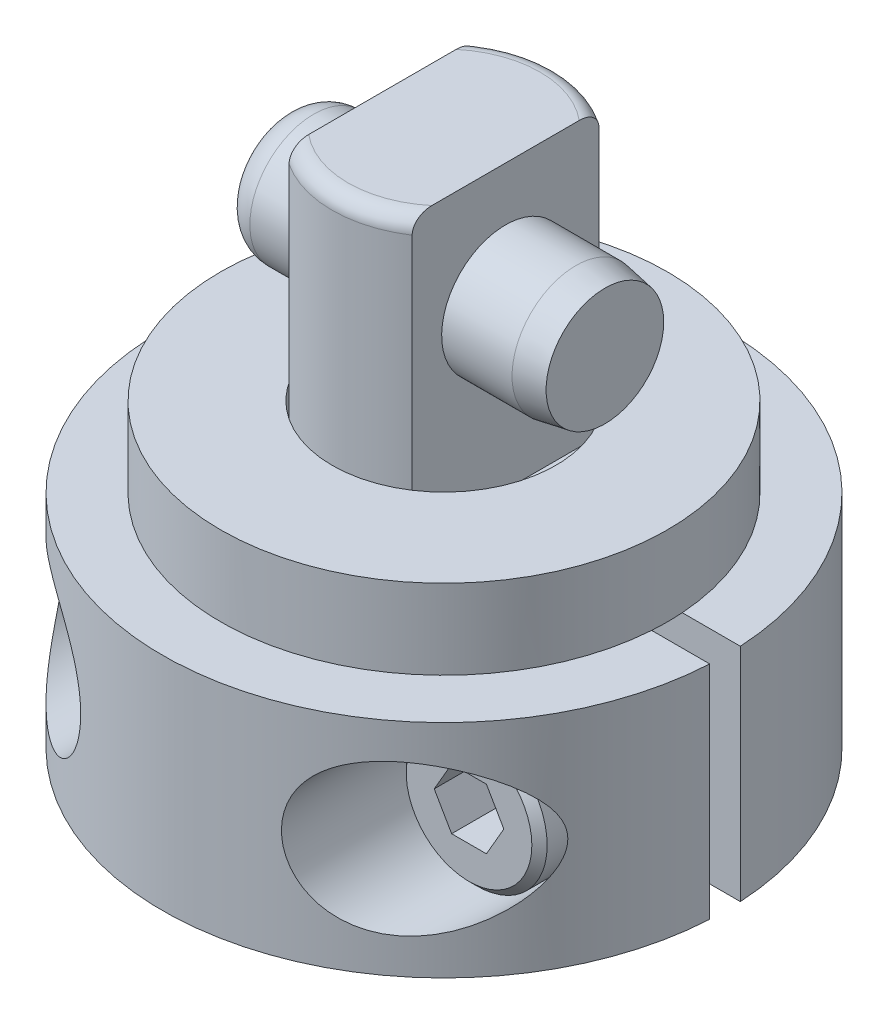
ISO-10303-21;
HEADER;
FILE_DESCRIPTION(('STEP AP214'),'2;1');
FILE_NAME('part.step','',(''),(''),'','','');
FILE_SCHEMA(('AUTOMOTIVE_DESIGN { 1 0 10303 214 1 1 1 1 }'));
ENDSEC;
DATA;
#1=APPLICATION_CONTEXT('core data for automotive mechanical design processes');
#2=APPLICATION_PROTOCOL_DEFINITION('international standard','automotive_design',2000,#1);
#3=PRODUCT_CONTEXT('',#1,'mechanical');
#4=PRODUCT('Part','Part','',(#3));
#5=PRODUCT_RELATED_PRODUCT_CATEGORY('part','',(#4));
#6=PRODUCT_DEFINITION_FORMATION('','',#4);
#7=PRODUCT_DEFINITION_CONTEXT('part definition',#1,'design');
#8=PRODUCT_DEFINITION('design','',#6,#7);
#9=PRODUCT_DEFINITION_SHAPE('','',#8);
#10=(LENGTH_UNIT() NAMED_UNIT(*) SI_UNIT(.MILLI.,.METRE.));
#11=(NAMED_UNIT(*) PLANE_ANGLE_UNIT() SI_UNIT($,.RADIAN.));
#12=(NAMED_UNIT(*) SI_UNIT($,.STERADIAN.) SOLID_ANGLE_UNIT());
#13=UNCERTAINTY_MEASURE_WITH_UNIT(LENGTH_MEASURE(1.E-05),#10,'distance_accuracy_value','');
#14=(GEOMETRIC_REPRESENTATION_CONTEXT(3) GLOBAL_UNCERTAINTY_ASSIGNED_CONTEXT((#13)) GLOBAL_UNIT_ASSIGNED_CONTEXT((#10,
#11,#12)) REPRESENTATION_CONTEXT('',''));
#15=CARTESIAN_POINT('',(0.,0.,0.));
#16=DIRECTION('',(0.,0.,1.));
#17=DIRECTION('',(1.,0.,0.));
#18=AXIS2_PLACEMENT_3D('',#15,#16,#17);
#19=CARTESIAN_POINT('',(0.,-15.35938,0.));
#20=DIRECTION('',(0.,-1.,0.));
#21=DIRECTION('',(0.,0.,-1.));
#22=AXIS2_PLACEMENT_3D('',#19,#20,#21);
#23=CYLINDRICAL_SURFACE('',#22,5.5626);
#24=DIRECTION('',(0.,1.,0.));
#25=VECTOR('',#24,1.);
#26=CARTESIAN_POINT('',(-5.51016104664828,-5.4991,0.762));
#27=LINE('',#26,#25);
#28=CARTESIAN_POINT('',(-5.51016104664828,0.6096,0.762));
#29=VERTEX_POINT('',#28);
#30=CARTESIAN_POINT('',(-5.51016104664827,5.4991,0.761999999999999));
#31=VERTEX_POINT('',#30);
#32=EDGE_CURVE('E445',#29,#31,#27,.T.);
#33=ORIENTED_EDGE('',*,*,#32,.T.);
#34=CARTESIAN_POINT('',(0.,5.4991,0.));
#35=DIRECTION('',(0.,1.,0.));
#36=DIRECTION('',(0.,0.,1.));
#37=AXIS2_PLACEMENT_3D('',#34,#35,#36);
#38=CIRCLE('',#37,5.5626);
#39=CARTESIAN_POINT('',(-5.51016104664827,5.4991,-0.761999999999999));
#40=VERTEX_POINT('',#39);
#41=EDGE_CURVE('E594',#40,#31,#38,.T.);
#42=ORIENTED_EDGE('',*,*,#41,.F.);
#43=DIRECTION('',(0.,1.,0.));
#44=VECTOR('',#43,1.);
#45=CARTESIAN_POINT('',(-5.51016104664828,-5.4991,-0.762));
#46=LINE('',#45,#44);
#47=CARTESIAN_POINT('',(-5.51016104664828,0.609600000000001,-0.762));
#48=VERTEX_POINT('',#47);
#49=EDGE_CURVE('E418',#48,#40,#46,.T.);
#50=ORIENTED_EDGE('',*,*,#49,.F.);
#51=CARTESIAN_POINT('',(0.,0.6096,0.));
#52=DIRECTION('',(0.,-1.,0.));
#53=DIRECTION('',(0.,0.,-1.));
#54=AXIS2_PLACEMENT_3D('',#51,#52,#53);
#55=CIRCLE('',#54,5.5626);
#56=EDGE_CURVE('E297',#29,#48,#55,.T.);
#57=ORIENTED_EDGE('',*,*,#56,.F.);
#58=EDGE_LOOP('',(#33,#42,#50,#57));
#59=FACE_BOUND('',#58,.T.);
#60=ADVANCED_FACE('F33',(#59),#23,.T.);
#61=DIRECTION('',(0.,1.,0.));
#62=VECTOR('',#61,1.);
#63=CARTESIAN_POINT('',(5.51016104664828,-5.4991,-0.762));
#64=LINE('',#63,#62);
#65=CARTESIAN_POINT('',(5.51016104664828,0.6096,-0.762));
#66=VERTEX_POINT('',#65);
#67=CARTESIAN_POINT('',(5.51016104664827,5.4991,-0.761999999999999));
#68=VERTEX_POINT('',#67);
#69=EDGE_CURVE('E413',#66,#68,#64,.T.);
#70=ORIENTED_EDGE('',*,*,#69,.T.);
#71=CARTESIAN_POINT('',(5.51016104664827,5.4991,0.761999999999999));
#72=VERTEX_POINT('',#71);
#73=EDGE_CURVE('E275',#72,#68,#38,.T.);
#74=ORIENTED_EDGE('',*,*,#73,.F.);
#75=DIRECTION('',(0.,1.,0.));
#76=VECTOR('',#75,1.);
#77=CARTESIAN_POINT('',(5.51016104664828,-5.4991,0.762));
#78=LINE('',#77,#76);
#79=CARTESIAN_POINT('',(5.51016104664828,0.609600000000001,0.762));
#80=VERTEX_POINT('',#79);
#81=EDGE_CURVE('E450',#80,#72,#78,.T.);
#82=ORIENTED_EDGE('',*,*,#81,.F.);
#83=EDGE_CURVE('E292',#66,#80,#55,.T.);
#84=ORIENTED_EDGE('',*,*,#83,.F.);
#85=EDGE_LOOP('',(#70,#74,#82,#84));
#86=FACE_BOUND('',#85,.T.);
#87=ADVANCED_FACE('F344',(#86),#23,.T.);
#88=CARTESIAN_POINT('',(0.,5.4991,0.));
#89=DIRECTION('',(0.,1.,0.));
#90=DIRECTION('',(0.,0.,1.));
#91=AXIS2_PLACEMENT_3D('',#88,#89,#90);
#92=PLANE('',#91);
#93=DIRECTION('',(1.,0.,0.));
#94=VECTOR('',#93,1.);
#95=CARTESIAN_POINT('',(-5.51016104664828,5.4991,-0.762));
#96=LINE('',#95,#94);
#97=CARTESIAN_POINT('',(-13.974640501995,5.4991,-0.762000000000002));
#98=VERTEX_POINT('',#97);
#99=CARTESIAN_POINT('',(-11.0863435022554,5.4991,-0.762000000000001));
#100=VERTEX_POINT('',#99);
#101=EDGE_CURVE('E433',#98,#100,#96,.T.);
#102=ORIENTED_EDGE('',*,*,#101,.T.);
#103=CARTESIAN_POINT('',(0.,5.4991,0.));
#104=DIRECTION('',(0.,1.,0.));
#105=DIRECTION('',(0.,0.,1.));
#106=AXIS2_PLACEMENT_3D('',#103,#104,#105);
#107=CIRCLE('',#106,11.1125);
#108=CARTESIAN_POINT('',(11.0863435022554,5.4991,-0.762000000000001));
#109=VERTEX_POINT('',#108);
#110=EDGE_CURVE('E591',#109,#100,#107,.T.);
#111=ORIENTED_EDGE('',*,*,#110,.F.);
#112=DIRECTION('',(1.,0.,0.));
#113=VECTOR('',#112,1.);
#114=CARTESIAN_POINT('',(5.51016104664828,5.4991,-0.762));
#115=LINE('',#114,#113);
#116=CARTESIAN_POINT('',(13.974640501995,5.4991,-0.762000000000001));
#117=VERTEX_POINT('',#116);
#118=EDGE_CURVE('E441',#109,#117,#115,.T.);
#119=ORIENTED_EDGE('',*,*,#118,.T.);
#120=CARTESIAN_POINT('',(0.,5.4991,0.));
#121=DIRECTION('',(0.,1.,0.));
#122=DIRECTION('',(0.,0.,1.));
#123=AXIS2_PLACEMENT_3D('',#120,#121,#122);
#124=CIRCLE('',#123,13.9954);
#125=EDGE_CURVE('E436',#117,#98,#124,.T.);
#126=ORIENTED_EDGE('',*,*,#125,.T.);
#127=EDGE_LOOP('',(#102,#111,#119,#126));
#128=FACE_BOUND('',#127,.T.);
#129=ADVANCED_FACE('F364',(#128),#92,.T.);
#130=CARTESIAN_POINT('',(0.,5.4991,0.));
#131=DIRECTION('',(0.,1.,0.));
#132=DIRECTION('',(0.,0.,1.));
#133=AXIS2_PLACEMENT_3D('',#130,#131,#132);
#134=PLANE('',#133);
#135=DIRECTION('',(-1.,0.,0.));
#136=VECTOR('',#135,1.);
#137=CARTESIAN_POINT('',(5.51016104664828,5.4991,0.762));
#138=LINE('',#137,#136);
#139=CARTESIAN_POINT('',(13.974640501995,5.4991,0.762000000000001));
#140=VERTEX_POINT('',#139);
#141=CARTESIAN_POINT('',(11.0863435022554,5.4991,0.762000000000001));
#142=VERTEX_POINT('',#141);
#143=EDGE_CURVE('E466',#140,#142,#138,.T.);
#144=ORIENTED_EDGE('',*,*,#143,.T.);
#145=CARTESIAN_POINT('',(0.,5.4991,0.));
#146=DIRECTION('',(0.,1.,0.));
#147=DIRECTION('',(0.,0.,1.));
#148=AXIS2_PLACEMENT_3D('',#145,#146,#147);
#149=CIRCLE('',#148,11.1125);
#150=CARTESIAN_POINT('',(-11.0863435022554,5.4991,0.762000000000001));
#151=VERTEX_POINT('',#150);
#152=EDGE_CURVE('E11',#142,#151,#149,.F.);
#153=ORIENTED_EDGE('',*,*,#152,.T.);
#154=DIRECTION('',(-1.,0.,0.));
#155=VECTOR('',#154,1.);
#156=CARTESIAN_POINT('',(-5.51016104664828,5.4991,0.762));
#157=LINE('',#156,#155);
#158=CARTESIAN_POINT('',(-13.974640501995,5.4991,0.761999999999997));
#159=VERTEX_POINT('',#158);
#160=EDGE_CURVE('E475',#151,#159,#157,.T.);
#161=ORIENTED_EDGE('',*,*,#160,.T.);
#162=CARTESIAN_POINT('',(0.,5.4991,0.));
#163=DIRECTION('',(0.,1.,0.));
#164=DIRECTION('',(0.,0.,1.));
#165=AXIS2_PLACEMENT_3D('',#162,#163,#164);
#166=CIRCLE('',#165,13.9954);
#167=EDGE_CURVE('E470',#159,#140,#166,.T.);
#168=ORIENTED_EDGE('',*,*,#167,.T.);
#169=EDGE_LOOP('',(#144,#153,#161,#168));
#170=FACE_BOUND('',#169,.T.);
#171=ADVANCED_FACE('F635',(#170),#134,.T.);
#172=CARTESIAN_POINT('',(-8.7376,0.,3.5052));
#173=DIRECTION('',(0.,0.,1.));
#174=DIRECTION('',(1.,0.,0.));
#175=AXIS2_PLACEMENT_3D('',#172,#173,#174);
#176=PLANE('',#175);
#177=CARTESIAN_POINT('',(-8.7376,0.,3.5052));
#178=DIRECTION('',(0.,0.,1.));
#179=DIRECTION('',(1.,0.,0.));
#180=AXIS2_PLACEMENT_3D('',#177,#178,#179);
#181=CIRCLE('',#180,3.7465);
#182=CARTESIAN_POINT('',(-4.9911,0.,3.5052));
#183=VERTEX_POINT('',#182);
#184=EDGE_CURVE('E481',#183,#183,#181,.T.);
#185=ORIENTED_EDGE('',*,*,#184,.T.);
#186=EDGE_LOOP('',(#185));
#187=FACE_BOUND('',#186,.T.);
#188=CARTESIAN_POINT('',(-8.7376,0.,3.5052));
#189=DIRECTION('',(0.,0.,1.));
#190=DIRECTION('',(1.,0.,0.));
#191=AXIS2_PLACEMENT_3D('',#188,#189,#190);
#192=CIRCLE('',#191,3.5052);
#193=CARTESIAN_POINT('',(-5.2324,0.,3.5052));
#194=VERTEX_POINT('',#193);
#195=EDGE_CURVE('E487',#194,#194,#192,.T.);
#196=ORIENTED_EDGE('',*,*,#195,.F.);
#197=EDGE_LOOP('',(#196));
#198=FACE_BOUND('',#197,.T.);
#199=ADVANCED_FACE('F665',(#187,#198),#176,.T.);
#200=CARTESIAN_POINT('',(8.7376,0.,3.5052));
#201=DIRECTION('',(0.,0.,1.));
#202=DIRECTION('',(1.,0.,0.));
#203=AXIS2_PLACEMENT_3D('',#200,#201,#202);
#204=PLANE('',#203);
#205=CARTESIAN_POINT('',(8.7376,0.,3.5052));
#206=DIRECTION('',(0.,0.,1.));
#207=DIRECTION('',(1.,0.,0.));
#208=AXIS2_PLACEMENT_3D('',#205,#206,#207);
#209=CIRCLE('',#208,3.7465);
#210=CARTESIAN_POINT('',(12.4841,0.,3.5052));
#211=VERTEX_POINT('',#210);
#212=EDGE_CURVE('E476',#211,#211,#209,.T.);
#213=ORIENTED_EDGE('',*,*,#212,.T.);
#214=EDGE_LOOP('',(#213));
#215=FACE_BOUND('',#214,.T.);
#216=CARTESIAN_POINT('',(8.7376,0.,3.5052));
#217=DIRECTION('',(0.,0.,1.));
#218=DIRECTION('',(1.,0.,0.));
#219=AXIS2_PLACEMENT_3D('',#216,#217,#218);
#220=CIRCLE('',#219,3.5052);
#221=CARTESIAN_POINT('',(12.2428,0.,3.5052));
#222=VERTEX_POINT('',#221);
#223=EDGE_CURVE('E484',#222,#222,#220,.T.);
#224=ORIENTED_EDGE('',*,*,#223,.F.);
#225=EDGE_LOOP('',(#224));
#226=FACE_BOUND('',#225,.T.);
#227=ADVANCED_FACE('F662',(#215,#226),#204,.T.);
#228=CARTESIAN_POINT('',(0.,-5.4991,0.));
#229=DIRECTION('',(0.,1.,0.));
#230=DIRECTION('',(0.,0.,1.));
#231=AXIS2_PLACEMENT_3D('',#228,#229,#230);
#232=CYLINDRICAL_SURFACE('',#231,13.9954);
#233=CARTESIAN_POINT('',(4.9911,0.,13.0751727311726));
#234=CARTESIAN_POINT('',(4.99110061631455,0.098891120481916,13.0751727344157));
#235=CARTESIAN_POINT('',(4.99502029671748,0.197813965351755,13.0736783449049));
#236=CARTESIAN_POINT('',(5.01066637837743,0.394992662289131,13.0676896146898));
#237=CARTESIAN_POINT('',(5.02239755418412,0.493248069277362,13.0631934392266));
#238=CARTESIAN_POINT('',(5.05358492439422,0.688542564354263,13.0511601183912));
#239=CARTESIAN_POINT('',(5.07305648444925,0.785578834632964,13.0436169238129));
#240=CARTESIAN_POINT('',(5.11953763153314,0.977571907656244,13.0254434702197));
#241=CARTESIAN_POINT('',(5.14655011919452,1.07252789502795,13.0148120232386));
#242=CARTESIAN_POINT('',(5.20778015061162,1.2594805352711,12.9904322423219));
#243=CARTESIAN_POINT('',(5.24198442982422,1.35148228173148,12.9766896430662));
#244=CARTESIAN_POINT('',(5.31729385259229,1.53210503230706,12.9460132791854));
#245=CARTESIAN_POINT('',(5.35840152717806,1.6207247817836,12.9290783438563));
#246=CARTESIAN_POINT('',(5.44704479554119,1.79386668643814,12.8919831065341));
#247=CARTESIAN_POINT('',(5.49457387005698,1.8783928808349,12.8718260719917));
#248=CARTESIAN_POINT('',(5.5956239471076,2.04293293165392,12.8282205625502));
#249=CARTESIAN_POINT('',(5.64914717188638,2.12294509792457,12.8047708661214));
#250=CARTESIAN_POINT('',(5.76223641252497,2.27877961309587,12.7542825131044));
#251=CARTESIAN_POINT('',(5.82186097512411,2.35454795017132,12.7272081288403));
#252=CARTESIAN_POINT('',(5.94605794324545,2.50055160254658,12.669661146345));
#253=CARTESIAN_POINT('',(6.01063212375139,2.57078491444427,12.6391873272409));
#254=CARTESIAN_POINT('',(6.21080018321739,2.77260860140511,12.5426884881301));
#255=CARTESIAN_POINT('',(6.35292843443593,2.89544369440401,12.4715472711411));
#256=CARTESIAN_POINT('',(6.65644770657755,3.12132941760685,12.3123403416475));
#257=CARTESIAN_POINT('',(6.81844803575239,3.22307418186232,12.2236033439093));
#258=CARTESIAN_POINT('',(7.14963325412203,3.39849416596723,12.0328924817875));
#259=CARTESIAN_POINT('',(7.31882027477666,3.47216099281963,11.9309146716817));
#260=CARTESIAN_POINT('',(7.67825431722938,3.59921466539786,11.7032372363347));
#261=CARTESIAN_POINT('',(7.86874330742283,3.64941818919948,11.5761602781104));
#262=CARTESIAN_POINT('',(8.24688044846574,3.71920458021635,11.3098956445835));
#263=CARTESIAN_POINT('',(8.43452630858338,3.73876393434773,11.1706987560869));
#264=CARTESIAN_POINT('',(8.75484872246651,3.74893652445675,10.9203384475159));
#265=CARTESIAN_POINT('',(8.88909002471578,3.74577212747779,10.8113401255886));
#266=CARTESIAN_POINT('',(9.15289521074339,3.72576074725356,10.5889321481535));
#267=CARTESIAN_POINT('',(9.28245724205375,3.70890840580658,10.4755207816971));
#268=CARTESIAN_POINT('',(9.53626146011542,3.66265903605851,10.2450176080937));
#269=CARTESIAN_POINT('',(9.66049540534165,3.63324329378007,10.1279205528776));
#270=CARTESIAN_POINT('',(9.90291794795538,3.56289553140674,9.89101404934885));
#271=CARTESIAN_POINT('',(10.0211071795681,3.52196472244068,9.77120488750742));
#272=CARTESIAN_POINT('',(10.2530755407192,3.42862872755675,9.52756211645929));
#273=CARTESIAN_POINT('',(10.3667447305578,3.37603933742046,9.40369472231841));
#274=CARTESIAN_POINT('',(10.5872477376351,3.26045461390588,9.15472881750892));
#275=CARTESIAN_POINT('',(10.6940809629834,3.19745838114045,9.02963020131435));
#276=CARTESIAN_POINT('',(10.9006950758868,3.06146662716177,8.7790904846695));
#277=CARTESIAN_POINT('',(11.0004770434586,2.98847264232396,8.65364943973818));
#278=CARTESIAN_POINT('',(11.1928059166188,2.83258758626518,8.40340411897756));
#279=CARTESIAN_POINT('',(11.2853543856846,2.74969866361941,8.27859971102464));
#280=CARTESIAN_POINT('',(11.4413317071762,2.59519367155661,8.06104520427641));
#281=CARTESIAN_POINT('',(11.506361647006,2.52575122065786,7.96789365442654));
#282=CARTESIAN_POINT('',(11.631975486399,2.38076758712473,7.78336786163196));
#283=CARTESIAN_POINT('',(11.6925601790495,2.30522749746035,7.69199330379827));
#284=CARTESIAN_POINT('',(11.8089734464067,2.14767627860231,7.51204569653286));
#285=CARTESIAN_POINT('',(11.8648077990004,2.06567325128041,7.42346932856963));
#286=CARTESIAN_POINT('',(11.9713848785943,1.89448093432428,7.25034419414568));
#287=CARTESIAN_POINT('',(12.0221301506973,1.80529527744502,7.16579342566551));
#288=CARTESIAN_POINT('',(12.1252178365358,1.60465344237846,6.99014763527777));
#289=CARTESIAN_POINT('',(12.1766363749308,1.49187067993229,6.90000334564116));
#290=CARTESIAN_POINT('',(12.270340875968,1.25392083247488,6.73195132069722));
#291=CARTESIAN_POINT('',(12.3126379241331,1.12876905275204,6.65402876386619));
#292=CARTESIAN_POINT('',(12.3761367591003,0.898699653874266,6.53496865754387));
#293=CARTESIAN_POINT('',(12.3999671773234,0.796785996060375,6.48951961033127));
#294=CARTESIAN_POINT('',(12.4395190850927,0.586086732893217,6.41337955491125));
#295=CARTESIAN_POINT('',(12.4552541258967,0.477312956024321,6.38266388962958));
#296=CARTESIAN_POINT('',(12.4771991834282,0.253729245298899,6.33966520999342));
#297=CARTESIAN_POINT('',(12.4832947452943,0.13886327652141,6.32760372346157));
#298=CARTESIAN_POINT('',(12.4847536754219,-0.0912024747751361,6.32472581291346));
#299=CARTESIAN_POINT('',(12.48011984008,-0.206402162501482,6.3339038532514));
#300=CARTESIAN_POINT('',(12.4623236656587,-0.414582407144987,6.36882913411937));
#301=CARTESIAN_POINT('',(12.4506230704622,-0.508199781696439,6.39173212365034));
#302=CARTESIAN_POINT('',(12.4210301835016,-0.690769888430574,6.44905247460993));
#303=CARTESIAN_POINT('',(12.4031342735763,-0.779719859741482,6.48347656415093));
#304=CARTESIAN_POINT('',(12.3473953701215,-1.01436233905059,6.5892848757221));
#305=CARTESIAN_POINT('',(12.3044637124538,-1.15484692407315,6.66944361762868));
#306=CARTESIAN_POINT('',(12.2071107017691,-1.4209024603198,6.8460143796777));
#307=CARTESIAN_POINT('',(12.1526473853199,-1.5464162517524,6.94248549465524));
#308=CARTESIAN_POINT('',(12.0390931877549,-1.77521639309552,7.13745227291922));
#309=CARTESIAN_POINT('',(11.9806778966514,-1.87946926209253,7.23522479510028));
#310=CARTESIAN_POINT('',(11.8569876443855,-2.0783181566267,7.43619593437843));
#311=CARTESIAN_POINT('',(11.7917071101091,-2.17290621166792,7.5393989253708));
#312=CARTESIAN_POINT('',(11.6547822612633,-2.35354408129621,7.749388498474));
#313=CARTESIAN_POINT('',(11.5831260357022,-2.43957725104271,7.85618154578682));
#314=CARTESIAN_POINT('',(11.4339275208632,-2.60352776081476,8.0717853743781));
#315=CARTESIAN_POINT('',(11.3563864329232,-2.68144674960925,8.18059574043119));
#316=CARTESIAN_POINT('',(11.1670760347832,-2.85584565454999,8.4380934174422));
#317=CARTESIAN_POINT('',(11.0529256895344,-2.94909872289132,8.58722804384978));
#318=CARTESIAN_POINT('',(10.81451282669,-3.12159232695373,8.88560851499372));
#319=CARTESIAN_POINT('',(10.6902464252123,-3.20082744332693,9.03485438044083));
#320=CARTESIAN_POINT('',(10.4320962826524,-3.34465948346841,9.33173276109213));
#321=CARTESIAN_POINT('',(10.2982245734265,-3.40927431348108,9.47936703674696));
#322=CARTESIAN_POINT('',(10.021160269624,-3.52294478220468,9.77180135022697));
#323=CARTESIAN_POINT('',(9.87797144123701,-3.57200666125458,9.91660250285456));
#324=CARTESIAN_POINT('',(9.61837927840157,-3.64334885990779,10.1677101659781));
#325=CARTESIAN_POINT('',(9.50381335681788,-3.66923218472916,10.2749013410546));
#326=CARTESIAN_POINT('',(9.27008299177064,-3.71036379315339,10.4862571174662));
#327=CARTESIAN_POINT('',(9.15091956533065,-3.72561441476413,10.5904223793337));
#328=CARTESIAN_POINT('',(8.90871214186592,-3.74455884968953,10.794960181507));
#329=CARTESIAN_POINT('',(8.78567295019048,-3.74826644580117,10.895337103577));
#330=CARTESIAN_POINT('',(8.53639888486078,-3.74316871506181,11.0917207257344));
#331=CARTESIAN_POINT('',(8.4101646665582,-3.73436593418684,11.1877283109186));
#332=CARTESIAN_POINT('',(8.18074780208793,-3.70631450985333,11.3561727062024));
#333=CARTESIAN_POINT('',(8.07793648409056,-3.68947233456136,11.429519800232));
#334=CARTESIAN_POINT('',(7.87168559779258,-3.64657980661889,11.5725331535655));
#335=CARTESIAN_POINT('',(7.7682461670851,-3.62053140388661,11.6422001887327));
#336=CARTESIAN_POINT('',(7.56155518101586,-3.55876616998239,11.7774939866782));
#337=CARTESIAN_POINT('',(7.45830367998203,-3.52304688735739,11.8431197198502));
#338=CARTESIAN_POINT('',(7.25307505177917,-3.44160249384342,11.9699065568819));
#339=CARTESIAN_POINT('',(7.15109729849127,-3.39588252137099,12.031069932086));
#340=CARTESIAN_POINT('',(6.9486235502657,-3.29375053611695,12.1491442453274));
#341=CARTESIAN_POINT('',(6.84814841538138,-3.2372482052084,12.2060131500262));
#342=CARTESIAN_POINT('',(6.65095474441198,-3.11379131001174,12.3145720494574));
#343=CARTESIAN_POINT('',(6.55423434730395,-3.04684200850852,12.3662646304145));
#344=CARTESIAN_POINT('',(6.36591483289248,-2.90265889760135,12.4642534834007));
#345=CARTESIAN_POINT('',(6.27431364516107,-2.82542928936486,12.5105519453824));
#346=CARTESIAN_POINT('',(6.09760783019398,-2.66106296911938,12.5976228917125));
#347=CARTESIAN_POINT('',(6.01250207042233,-2.57392799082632,12.6383963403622));
#348=CARTESIAN_POINT('',(5.86139378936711,-2.40309181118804,12.7091012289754));
#349=CARTESIAN_POINT('',(5.79437704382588,-2.32058208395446,12.73975225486));
#350=CARTESIAN_POINT('',(5.6670163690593,-2.14922544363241,12.7969144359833));
#351=CARTESIAN_POINT('',(5.60667169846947,-2.06037923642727,12.8234260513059));
#352=CARTESIAN_POINT('',(5.49339895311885,-1.8769770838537,12.8723579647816));
#353=CARTESIAN_POINT('',(5.44047289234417,-1.78241959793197,12.8947771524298));
#354=CARTESIAN_POINT('',(5.34273225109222,-1.58837464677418,12.935580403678));
#355=CARTESIAN_POINT('',(5.2979169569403,-1.48888761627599,12.9539648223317));
#356=CARTESIAN_POINT('',(5.22028367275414,-1.29414822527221,12.9854328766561));
#357=CARTESIAN_POINT('',(5.18678337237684,-1.1992172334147,12.998827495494));
#358=CARTESIAN_POINT('',(5.12745083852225,-1.00659734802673,13.0223457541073));
#359=CARTESIAN_POINT('',(5.10161799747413,-0.90890867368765,13.0324696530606));
#360=CARTESIAN_POINT('',(5.05794484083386,-0.711739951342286,13.0494813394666));
#361=CARTESIAN_POINT('',(5.0400853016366,-0.61226482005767,13.0563769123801));
#362=CARTESIAN_POINT('',(5.01246161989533,-0.412074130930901,13.0670069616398));
#363=CARTESIAN_POINT('',(5.00269245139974,-0.311359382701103,13.0707434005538));
#364=CARTESIAN_POINT('',(4.99504274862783,-0.175385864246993,13.0736670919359));
#365=CARTESIAN_POINT('',(4.99356458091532,-0.14032874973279,13.0742317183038));
#366=CARTESIAN_POINT('',(4.99159309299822,-0.0701824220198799,13.0749845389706));
#367=CARTESIAN_POINT('',(4.99109978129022,-0.0350932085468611,13.0751727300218));
#368=CARTESIAN_POINT('',(4.9911,0.,13.0751727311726));
#369=B_SPLINE_CURVE_WITH_KNOTS('',3,(#233,#234,#235,#236,#237,#238,#239,#240,#241,#242,#243,
#244,#245,#246,#247,#248,#249,#250,#251,#252,#253,#254,#255,#256,#257,#258,#259,#260,#261,#262,
#263,#264,#265,#266,#267,#268,#269,#270,#271,#272,#273,#274,#275,#276,#277,#278,#279,#280,#281,
#282,#283,#284,#285,#286,#287,#288,#289,#290,#291,#292,#293,#294,#295,#296,#297,#298,#299,#300,
#301,#302,#303,#304,#305,#306,#307,#308,#309,#310,#311,#312,#313,#314,#315,#316,#317,#318,#319,
#320,#321,#322,#323,#324,#325,#326,#327,#328,#329,#330,#331,#332,#333,#334,#335,#336,#337,#338,
#339,#340,#341,#342,#343,#344,#345,#346,#347,#348,#349,#350,#351,#352,#353,#354,#355,#356,#357,
#358,#359,#360,#361,#362,#363,#364,#365,#366,#367,#368),.UNSPECIFIED.,.T.,.F.,(4,2,2,2,2,2,2,2,
2,2,2,2,2,2,2,2,2,2,2,2,2,2,2,2,2,2,2,2,2,2,2,2,2,2,2,2,2,2,2,2,2,2,2,2,2,2,2,2,2,2,2,2,2,2,2,2,
2,2,2,2,2,2,2,2,2,2,2,4),(0.,0.296639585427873,0.593460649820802,0.890873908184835,
1.18840172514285,1.48538552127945,1.78247844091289,2.07927197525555,2.37617590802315,
2.67625772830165,2.97644766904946,3.57636790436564,4.20646270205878,4.83674569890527,
5.53741269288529,6.23861704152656,6.75681330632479,7.27521251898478,7.79438662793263,
8.31350615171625,8.84150060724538,9.36954071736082,9.89749977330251,10.4253443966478,
10.8245883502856,11.2237608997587,11.62244077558,12.0209202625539,12.4798018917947,
12.9381226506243,13.2793021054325,13.619908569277,13.9645296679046,14.3090609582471,
14.5992059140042,14.8895206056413,15.3886618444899,15.8896516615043,16.3522057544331,
16.8151382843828,17.2789545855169,17.7426764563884,18.3709721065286,18.9995101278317,
19.6272741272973,20.2547859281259,20.7314222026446,21.2079536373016,21.6839158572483,
22.159781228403,22.5416615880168,22.9234611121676,23.305357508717,23.6870581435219,
24.0721088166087,24.4569661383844,24.8416666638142,25.226299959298,25.5577432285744,
25.889149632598,26.2206458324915,26.5521128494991,26.8564088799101,27.1606807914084,
27.4642150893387,27.7675606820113,27.8728274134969,27.9780950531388),.UNSPECIFIED.);
#370=CARTESIAN_POINT('',(4.9911,0.,13.0751727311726));
#371=VERTEX_POINT('',#370);
#372=EDGE_CURVE('E479',#371,#371,#369,.T.);
#373=ORIENTED_EDGE('',*,*,#372,.T.);
#374=EDGE_LOOP('',(#373));
#375=FACE_BOUND('',#374,.T.);
#376=DIRECTION('',(0.,1.,0.));
#377=VECTOR('',#376,1.);
#378=CARTESIAN_POINT('',(13.974640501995,-5.4991,0.762000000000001));
#379=LINE('',#378,#377);
#380=CARTESIAN_POINT('',(13.974640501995,-5.4991,0.762000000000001));
#381=VERTEX_POINT('',#380);
#382=EDGE_CURVE('E448',#381,#140,#379,.T.);
#383=ORIENTED_EDGE('',*,*,#382,.T.);
#384=ORIENTED_EDGE('',*,*,#167,.F.);
#385=DIRECTION('',(0.,1.,0.));
#386=VECTOR('',#385,1.);
#387=CARTESIAN_POINT('',(-13.974640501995,-5.4991,0.761999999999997));
#388=LINE('',#387,#386);
#389=CARTESIAN_POINT('',(-13.974640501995,-5.4991,0.761999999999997));
#390=VERTEX_POINT('',#389);
#391=EDGE_CURVE('E444',#390,#159,#388,.T.);
#392=ORIENTED_EDGE('',*,*,#391,.F.);
#393=CARTESIAN_POINT('',(0.,-5.4991,0.));
#394=DIRECTION('',(0.,1.,0.));
#395=DIRECTION('',(0.,0.,1.));
#396=AXIS2_PLACEMENT_3D('',#393,#394,#395);
#397=CIRCLE('',#396,13.9954);
#398=EDGE_CURVE('E457',#390,#381,#397,.T.);
#399=ORIENTED_EDGE('',*,*,#398,.T.);
#400=EDGE_LOOP('',(#383,#384,#392,#399));
#401=FACE_BOUND('',#400,.T.);
#402=CARTESIAN_POINT('',(-12.4841,0.,6.32601520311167));
#403=CARTESIAN_POINT('',(-12.4840926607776,0.106513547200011,6.32603267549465));
#404=CARTESIAN_POINT('',(-12.4795029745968,0.213105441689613,6.33511218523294));
#405=CARTESIAN_POINT('',(-12.4616678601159,0.422763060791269,6.37011830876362));
#406=CARTESIAN_POINT('',(-12.4484062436,0.52582181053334,6.39607642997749));
#407=CARTESIAN_POINT('',(-12.4092898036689,0.756662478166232,6.47171059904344));
#408=CARTESIAN_POINT('',(-12.3808263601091,0.882386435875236,6.52620823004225));
#409=CARTESIAN_POINT('',(-12.3141030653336,1.12274610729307,6.65124771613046));
#410=CARTESIAN_POINT('',(-12.2758177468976,1.23735191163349,6.72183122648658));
#411=CARTESIAN_POINT('',(-12.1966554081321,1.44283935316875,6.86430308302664));
#412=CARTESIAN_POINT('',(-12.1566553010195,1.53491272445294,6.934995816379));
#413=CARTESIAN_POINT('',(-12.0715525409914,1.71192175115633,7.08209480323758));
#414=CARTESIAN_POINT('',(-12.0264459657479,1.79685183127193,7.15850543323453));
#415=CARTESIAN_POINT('',(-11.9316480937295,1.96042559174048,7.31542332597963));
#416=CARTESIAN_POINT('',(-11.8819482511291,2.0390570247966,7.39593809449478));
#417=CARTESIAN_POINT('',(-11.7783986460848,2.19048276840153,7.55975879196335));
#418=CARTESIAN_POINT('',(-11.7245475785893,2.26327522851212,7.6430655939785));
#419=CARTESIAN_POINT('',(-11.5759152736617,2.44999570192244,7.86750402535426));
#420=CARTESIAN_POINT('',(-11.4776844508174,2.55917046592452,8.01032704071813));
#421=CARTESIAN_POINT('',(-11.271095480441,2.76383654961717,8.29850174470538));
#422=CARTESIAN_POINT('',(-11.1627315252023,2.85931994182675,8.44385484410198));
#423=CARTESIAN_POINT('',(-10.9361521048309,3.03700083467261,8.7353251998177));
#424=CARTESIAN_POINT('',(-10.8179258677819,3.1191835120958,8.8814431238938));
#425=CARTESIAN_POINT('',(-10.5720445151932,3.26984003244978,9.1727544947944));
#426=CARTESIAN_POINT('',(-10.4443915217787,3.3383169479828,9.31794814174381));
#427=CARTESIAN_POINT('',(-10.1779757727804,3.46171185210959,9.60829977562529));
#428=CARTESIAN_POINT('',(-10.0390754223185,3.5164117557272,9.75342475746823));
#429=CARTESIAN_POINT('',(-9.7523388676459,3.60961100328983,10.0401298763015));
#430=CARTESIAN_POINT('',(-9.60450068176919,3.64810673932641,10.181709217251));
#431=CARTESIAN_POINT('',(-9.3012201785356,3.70707234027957,10.4594778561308));
#432=CARTESIAN_POINT('',(-9.14580310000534,3.72759822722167,10.5956826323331));
#433=CARTESIAN_POINT('',(-8.82828681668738,3.74877508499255,10.8616465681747));
#434=CARTESIAN_POINT('',(-8.66619236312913,3.7494399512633,10.9914101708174));
#435=CARTESIAN_POINT('',(-8.3986706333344,3.73256806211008,11.196001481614));
#436=CARTESIAN_POINT('',(-8.29465418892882,3.72172681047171,11.27326923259));
#437=CARTESIAN_POINT('',(-8.08543668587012,3.6908156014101,11.4242528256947));
#438=CARTESIAN_POINT('',(-7.98023599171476,3.6707484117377,11.4979697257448));
#439=CARTESIAN_POINT('',(-7.76942570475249,3.62086091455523,11.6414563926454));
#440=CARTESIAN_POINT('',(-7.66381607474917,3.59103969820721,11.711225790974));
#441=CARTESIAN_POINT('',(-7.45321262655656,3.52120868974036,11.8463701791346));
#442=CARTESIAN_POINT('',(-7.34821853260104,3.48120388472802,11.9117473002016));
#443=CARTESIAN_POINT('',(-7.13895105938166,3.39023878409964,12.0383425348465));
#444=CARTESIAN_POINT('',(-7.03469341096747,3.33918026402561,12.0995164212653));
#445=CARTESIAN_POINT('',(-6.8292554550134,3.22617686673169,12.2166470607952));
#446=CARTESIAN_POINT('',(-6.72807359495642,3.16423759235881,12.2726064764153));
#447=CARTESIAN_POINT('',(-6.53018335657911,3.02950443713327,12.379036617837));
#448=CARTESIAN_POINT('',(-6.43347360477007,2.95671391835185,12.4295090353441));
#449=CARTESIAN_POINT('',(-6.2459915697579,2.80054033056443,12.5247701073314));
#450=CARTESIAN_POINT('',(-6.15521822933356,2.71715915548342,12.5695597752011));
#451=CARTESIAN_POINT('',(-5.99309474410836,2.55252904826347,12.6475683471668));
#452=CARTESIAN_POINT('',(-5.92079132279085,2.4725679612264,12.6815312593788));
#453=CARTESIAN_POINT('',(-5.78262428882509,2.3056695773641,12.7451269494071));
#454=CARTESIAN_POINT('',(-5.71675984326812,2.21873318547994,12.774760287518));
#455=CARTESIAN_POINT('',(-5.59235099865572,2.03854217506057,12.8297099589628));
#456=CARTESIAN_POINT('',(-5.53380378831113,1.94529000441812,12.8550279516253));
#457=CARTESIAN_POINT('',(-5.4247749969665,1.75318224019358,12.9014165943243));
#458=CARTESIAN_POINT('',(-5.37429290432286,1.65432700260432,12.9224875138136));
#459=CARTESIAN_POINT('',(-5.28646416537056,1.46152415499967,12.9586478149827));
#460=CARTESIAN_POINT('',(-5.24832388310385,1.36800789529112,12.9741160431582));
#461=CARTESIAN_POINT('',(-5.17958670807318,1.17772598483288,13.0017105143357));
#462=CARTESIAN_POINT('',(-5.14899224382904,1.08095929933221,13.0138356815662));
#463=CARTESIAN_POINT('',(-5.09570932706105,0.884986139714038,13.0347914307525));
#464=CARTESIAN_POINT('',(-5.07301630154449,0.785781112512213,13.043623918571));
#465=CARTESIAN_POINT('',(-5.03574649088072,0.585587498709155,13.0580580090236));
#466=CARTESIAN_POINT('',(-5.02117266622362,0.484598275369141,13.0636584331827));
#467=CARTESIAN_POINT('',(-5.00063098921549,0.28477926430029,13.0715350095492));
#468=CARTESIAN_POINT('',(-4.9944112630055,0.185979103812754,13.0739084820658));
#469=CARTESIAN_POINT('',(-4.98981190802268,-0.0118666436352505,13.075664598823));
#470=CARTESIAN_POINT('',(-4.99143510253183,-0.110912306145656,13.0750461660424));
#471=CARTESIAN_POINT('',(-5.00250976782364,-0.308457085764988,13.0708129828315));
#472=CARTESIAN_POINT('',(-5.01195784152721,-0.406956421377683,13.0671995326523));
#473=CARTESIAN_POINT('',(-5.03858882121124,-0.602782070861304,13.0569539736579));
#474=CARTESIAN_POINT('',(-5.05577457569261,-0.700107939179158,13.0503207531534));
#475=CARTESIAN_POINT('',(-5.09759534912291,-0.892328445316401,13.0340416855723));
#476=CARTESIAN_POINT('',(-5.12218922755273,-0.987233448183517,13.024412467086));
#477=CARTESIAN_POINT('',(-5.17862380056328,-1.17452985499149,13.0020766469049));
#478=CARTESIAN_POINT('',(-5.2104671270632,-1.26692033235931,12.9893689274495));
#479=CARTESIAN_POINT('',(-5.28106180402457,-1.44847787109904,12.9608277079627));
#480=CARTESIAN_POINT('',(-5.31981022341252,-1.53764628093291,12.9449955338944));
#481=CARTESIAN_POINT('',(-5.40384783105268,-1.71223531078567,12.9101401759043));
#482=CARTESIAN_POINT('',(-5.44913943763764,-1.79765452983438,12.8911158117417));
#483=CARTESIAN_POINT('',(-5.54622016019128,-1.96488689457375,12.8496485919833));
#484=CARTESIAN_POINT('',(-5.59806213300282,-2.04666241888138,12.8271775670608));
#485=CARTESIAN_POINT('',(-5.70739717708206,-2.20531933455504,12.7789051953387));
#486=CARTESIAN_POINT('',(-5.76489228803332,-2.28219894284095,12.7531026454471));
#487=CARTESIAN_POINT('',(-5.94496552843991,-2.50474948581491,12.6706738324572));
#488=CARTESIAN_POINT('',(-6.07522702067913,-2.64249473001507,12.608986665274));
#489=CARTESIAN_POINT('',(-6.35585621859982,-2.89844238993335,12.4699503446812));
#490=CARTESIAN_POINT('',(-6.50677676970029,-3.01576865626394,12.392119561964));
#491=CARTESIAN_POINT('',(-6.81917244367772,-3.22352352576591,12.2229969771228));
#492=CARTESIAN_POINT('',(-6.98065034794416,-3.31394500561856,12.1317016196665));
#493=CARTESIAN_POINT('',(-7.32336804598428,-3.47493699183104,11.9282282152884));
#494=CARTESIAN_POINT('',(-7.50508904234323,-3.54303039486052,11.8149155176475));
#495=CARTESIAN_POINT('',(-7.86900935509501,-3.64935593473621,11.5757232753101));
#496=CARTESIAN_POINT('',(-8.0512088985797,-3.68756948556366,11.4498359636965));
#497=CARTESIAN_POINT('',(-8.36054555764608,-3.72975939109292,11.2248878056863));
#498=CARTESIAN_POINT('',(-8.48866912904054,-3.74036544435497,11.1283209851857));
#499=CARTESIAN_POINT('',(-8.74181056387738,-3.74863722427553,10.930587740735));
#500=CARTESIAN_POINT('',(-8.86682736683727,-3.74629859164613,10.8294197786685));
#501=CARTESIAN_POINT('',(-9.11300303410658,-3.72968945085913,10.6230995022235));
#502=CARTESIAN_POINT('',(-9.23415564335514,-3.71540052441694,10.5179412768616));
#503=CARTESIAN_POINT('',(-9.47179763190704,-3.67583045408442,10.3044552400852));
#504=CARTESIAN_POINT('',(-9.58828595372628,-3.65054683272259,10.1961267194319));
#505=CARTESIAN_POINT('',(-9.84650626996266,-3.58174444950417,9.94774335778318));
#506=CARTESIAN_POINT('',(-9.98669357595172,-3.53516186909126,9.80692638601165));
#507=CARTESIAN_POINT('',(-10.2582658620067,-3.42712810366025,9.52249424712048));
#508=CARTESIAN_POINT('',(-10.3896477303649,-3.36567169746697,9.37887811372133));
#509=CARTESIAN_POINT('',(-10.6433388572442,-3.22881112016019,9.08997025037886));
#510=CARTESIAN_POINT('',(-10.7656372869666,-3.15339066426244,8.9446767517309));
#511=CARTESIAN_POINT('',(-11.0006719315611,-2.98920086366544,8.65397852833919));
#512=CARTESIAN_POINT('',(-11.1134113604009,-2.90043603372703,8.50857385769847));
#513=CARTESIAN_POINT('',(-11.3022865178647,-2.73319611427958,8.25517764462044));
#514=CARTESIAN_POINT('',(-11.3805651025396,-2.6576301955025,8.1468522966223));
#515=CARTESIAN_POINT('',(-11.53135428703,-2.49864086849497,7.93197958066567));
#516=CARTESIAN_POINT('',(-11.6038660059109,-2.41521899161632,7.82543187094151));
#517=CARTESIAN_POINT('',(-11.7426204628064,-2.24021270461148,7.61563202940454));
#518=CARTESIAN_POINT('',(-11.8088811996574,-2.14865330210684,7.51237104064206));
#519=CARTESIAN_POINT('',(-11.9348325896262,-1.95631732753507,7.31061584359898));
#520=CARTESIAN_POINT('',(-11.9945281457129,-1.85554773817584,7.21211810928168));
#521=CARTESIAN_POINT('',(-12.1031932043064,-1.6497782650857,7.0281330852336));
#522=CARTESIAN_POINT('',(-12.1525905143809,-1.54539108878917,6.94222004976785));
#523=CARTESIAN_POINT('',(-12.2436657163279,-1.3258507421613,6.78030036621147));
#524=CARTESIAN_POINT('',(-12.2853438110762,-1.21069785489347,6.70429345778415));
#525=CARTESIAN_POINT('',(-12.3533204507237,-0.987074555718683,6.5780723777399));
#526=CARTESIAN_POINT('',(-12.380995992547,-0.880272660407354,6.52569158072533));
#527=CARTESIAN_POINT('',(-12.4274941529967,-0.658527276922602,6.43670407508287));
#528=CARTESIAN_POINT('',(-12.4463435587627,-0.543609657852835,6.40004966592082));
#529=CARTESIAN_POINT('',(-12.4677833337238,-0.356250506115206,6.35813664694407));
#530=CARTESIAN_POINT('',(-12.4738709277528,-0.285686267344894,6.34616802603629));
#531=CARTESIAN_POINT('',(-12.4820316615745,-0.143426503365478,6.33010155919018));
#532=CARTESIAN_POINT('',(-12.4841049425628,-0.0717310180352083,6.32600343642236));
#533=CARTESIAN_POINT('',(-12.4841,0.,6.32601520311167));
#534=B_SPLINE_CURVE_WITH_KNOTS('',3,(#402,#403,#404,#405,#406,#407,#408,#409,#410,#411,#412,
#413,#414,#415,#416,#417,#418,#419,#420,#421,#422,#423,#424,#425,#426,#427,#428,#429,#430,#431,
#432,#433,#434,#435,#436,#437,#438,#439,#440,#441,#442,#443,#444,#445,#446,#447,#448,#449,#450,
#451,#452,#453,#454,#455,#456,#457,#458,#459,#460,#461,#462,#463,#464,#465,#466,#467,#468,#469,
#470,#471,#472,#473,#474,#475,#476,#477,#478,#479,#480,#481,#482,#483,#484,#485,#486,#487,#488,
#489,#490,#491,#492,#493,#494,#495,#496,#497,#498,#499,#500,#501,#502,#503,#504,#505,#506,#507,
#508,#509,#510,#511,#512,#513,#514,#515,#516,#517,#518,#519,#520,#521,#522,#523,#524,#525,#526,
#527,#528,#529,#530,#531,#532,#533),.UNSPECIFIED.,.T.,.F.,(4,2,2,2,2,2,2,2,2,2,2,2,2,2,2,2,2,2,
2,2,2,2,2,2,2,2,2,2,2,2,2,2,2,2,2,2,2,2,2,2,2,2,2,2,2,2,2,2,2,2,2,2,2,2,2,2,2,2,2,2,2,2,2,2,2,
4),(0.,0.31923184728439,0.639061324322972,1.05653502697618,1.47510233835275,1.84292487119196,
2.21103187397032,2.57983808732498,2.94876072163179,3.562470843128,4.17653488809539,
4.79127864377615,5.40588442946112,6.02968149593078,6.65361737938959,7.27560110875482,
7.89714966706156,8.28690270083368,8.67653888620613,9.06621138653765,9.45569342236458,
9.8487899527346,10.2416846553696,10.6344578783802,11.0271609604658,11.3657805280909,
11.7043562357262,12.0428014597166,12.3812252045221,12.6873671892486,12.9936075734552,
13.2996704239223,13.6058448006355,13.9025637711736,14.1993895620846,14.496086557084,
14.7928928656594,15.0880803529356,15.3833751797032,15.6785449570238,15.9738241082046,
16.2716596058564,16.5696029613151,17.1649185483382,17.7815459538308,18.3983364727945,
19.069920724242,19.7419223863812,20.2236912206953,20.7056223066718,21.1882975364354,
21.6710815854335,22.2825127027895,22.8941587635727,23.5065226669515,24.1186798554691,
24.5789924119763,25.0392154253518,25.4980700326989,25.95657960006,26.3876877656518,
26.8187845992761,27.1839942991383,27.5480882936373,27.7630809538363,27.9780660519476),.UNSPECIFIED.);
#535=CARTESIAN_POINT('',(-12.4841,0.,6.32601520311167));
#536=VERTEX_POINT('',#535);
#537=EDGE_CURVE('E480',#536,#536,#534,.T.);
#538=ORIENTED_EDGE('',*,*,#537,.T.);
#539=EDGE_LOOP('',(#538));
#540=FACE_BOUND('',#539,.T.);
#541=ADVANCED_FACE('F339',(#375,#401,#540),#232,.T.);
#542=CARTESIAN_POINT('',(0.,0.609600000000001,-5.5626));
#543=DIRECTION('',(0.,-1.,0.));
#544=DIRECTION('',(0.,0.,-1.));
#545=AXIS2_PLACEMENT_3D('',#542,#543,#544);
#546=PLANE('',#545);
#547=ORIENTED_EDGE('',*,*,#83,.T.);
#548=EDGE_CURVE('E296',#80,#29,#55,.T.);
#549=ORIENTED_EDGE('',*,*,#548,.T.);
#550=ORIENTED_EDGE('',*,*,#56,.T.);
#551=EDGE_CURVE('E291',#48,#66,#55,.T.);
#552=ORIENTED_EDGE('',*,*,#551,.T.);
#553=EDGE_LOOP('',(#547,#549,#550,#552));
#554=FACE_BOUND('',#553,.T.);
#555=CARTESIAN_POINT('',(0.,0.609600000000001,0.));
#556=DIRECTION('',(0.,-1.,0.));
#557=DIRECTION('',(0.,0.,-1.));
#558=AXIS2_PLACEMENT_3D('',#555,#556,#557);
#559=CIRCLE('',#558,2.413);
#560=CARTESIAN_POINT('',(0.,0.609600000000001,-2.413));
#561=VERTEX_POINT('',#560);
#562=EDGE_CURVE('E399',#561,#561,#559,.T.);
#563=ORIENTED_EDGE('',*,*,#562,.F.);
#564=EDGE_LOOP('',(#563));
#565=FACE_BOUND('',#564,.T.);
#566=ADVANCED_FACE('F335',(#554,#565),#546,.T.);
#567=CARTESIAN_POINT('',(0.,-1.9304,0.));
#568=DIRECTION('',(0.,-1.,0.));
#569=DIRECTION('',(0.,0.,-1.));
#570=AXIS2_PLACEMENT_3D('',#567,#568,#569);
#571=PLANE('',#570);
#572=CARTESIAN_POINT('',(0.,-1.9304,0.));
#573=DIRECTION('',(0.,-1.,0.));
#574=DIRECTION('',(0.,0.,-1.));
#575=AXIS2_PLACEMENT_3D('',#572,#573,#574);
#576=CIRCLE('',#575,2.9972);
#577=CARTESIAN_POINT('',(0.,-1.9304,-2.9972));
#578=VERTEX_POINT('',#577);
#579=EDGE_CURVE('E394',#578,#578,#576,.T.);
#580=ORIENTED_EDGE('',*,*,#579,.F.);
#581=EDGE_LOOP('',(#580));
#582=FACE_BOUND('',#581,.T.);
#583=CARTESIAN_POINT('',(0.,-1.9304,0.));
#584=DIRECTION('',(0.,-1.,0.));
#585=DIRECTION('',(0.,0.,-1.));
#586=AXIS2_PLACEMENT_3D('',#583,#584,#585);
#587=CIRCLE('',#586,2.413);
#588=CARTESIAN_POINT('',(0.,-1.9304,-2.413));
#589=VERTEX_POINT('',#588);
#590=EDGE_CURVE('E398',#589,#589,#587,.T.);
#591=ORIENTED_EDGE('',*,*,#590,.T.);
#592=EDGE_LOOP('',(#591));
#593=FACE_BOUND('',#592,.T.);
#594=ADVANCED_FACE('F338',(#582,#593),#571,.F.);
#595=CARTESIAN_POINT('',(0.,-1.9304,0.));
#596=DIRECTION('',(0.,1.,0.));
#597=DIRECTION('',(0.,0.,1.));
#598=AXIS2_PLACEMENT_3D('',#595,#596,#597);
#599=CYLINDRICAL_SURFACE('',#598,2.413);
#600=ORIENTED_EDGE('',*,*,#590,.F.);
#601=EDGE_LOOP('',(#600));
#602=FACE_BOUND('',#601,.T.);
#603=ORIENTED_EDGE('',*,*,#562,.T.);
#604=EDGE_LOOP('',(#603));
#605=FACE_BOUND('',#604,.T.);
#606=ADVANCED_FACE('F329',(#602,#605),#599,.T.);
#607=CARTESIAN_POINT('',(0.,-5.7404,-2.9972));
#608=DIRECTION('',(0.,-1.,0.));
#609=DIRECTION('',(0.,0.,-1.));
#610=AXIS2_PLACEMENT_3D('',#607,#608,#609);
#611=PLANE('',#610);
#612=CARTESIAN_POINT('',(0.,-5.7404,0.));
#613=DIRECTION('',(0.,-1.,0.));
#614=DIRECTION('',(0.,0.,-1.));
#615=AXIS2_PLACEMENT_3D('',#612,#613,#614);
#616=CIRCLE('',#615,2.2352);
#617=CARTESIAN_POINT('',(0.,-5.7404,-2.2352));
#618=VERTEX_POINT('',#617);
#619=EDGE_CURVE('E761',#618,#618,#616,.T.);
#620=ORIENTED_EDGE('',*,*,#619,.T.);
#621=EDGE_LOOP('',(#620));
#622=FACE_BOUND('',#621,.T.);
#623=ADVANCED_FACE('F324',(#622),#611,.T.);
#624=CARTESIAN_POINT('',(0.,-15.35938,0.));
#625=DIRECTION('',(0.,-1.,0.));
#626=DIRECTION('',(0.,0.,-1.));
#627=AXIS2_PLACEMENT_3D('',#624,#625,#626);
#628=CYLINDRICAL_SURFACE('',#627,2.9972);
#629=CARTESIAN_POINT('',(0.,-4.9784,0.));
#630=DIRECTION('',(0.,-1.,0.));
#631=DIRECTION('',(0.,0.,-1.));
#632=AXIS2_PLACEMENT_3D('',#629,#630,#631);
#633=CIRCLE('',#632,2.9972);
#634=CARTESIAN_POINT('',(0.,-4.9784,-2.9972));
#635=VERTEX_POINT('',#634);
#636=EDGE_CURVE('E764',#635,#635,#633,.F.);
#637=ORIENTED_EDGE('',*,*,#636,.T.);
#638=EDGE_LOOP('',(#637));
#639=FACE_BOUND('',#638,.T.);
#640=ORIENTED_EDGE('',*,*,#579,.T.);
#641=EDGE_LOOP('',(#640));
#642=FACE_BOUND('',#641,.T.);
#643=ADVANCED_FACE('F328',(#639,#642),#628,.T.);
#644=CARTESIAN_POINT('',(0.,-5.7404,0.));
#645=DIRECTION('',(0.,1.,0.));
#646=DIRECTION('',(0.,0.,1.));
#647=AXIS2_PLACEMENT_3D('',#644,#645,#646);
#648=CONICAL_SURFACE('',#647,2.2352,0.785398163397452);
#649=ORIENTED_EDGE('',*,*,#636,.F.);
#650=EDGE_LOOP('',(#649));
#651=FACE_BOUND('',#650,.T.);
#652=ORIENTED_EDGE('',*,*,#619,.F.);
#653=EDGE_LOOP('',(#652));
#654=FACE_BOUND('',#653,.T.);
#655=ADVANCED_FACE('F333',(#651,#654),#648,.T.);
#656=CARTESIAN_POINT('',(0.,-5.4991,0.));
#657=DIRECTION('',(0.,1.,0.));
#658=DIRECTION('',(0.,0.,1.));
#659=AXIS2_PLACEMENT_3D('',#656,#657,#658);
#660=CYLINDRICAL_SURFACE('',#659,5.5626);
#661=CARTESIAN_POINT('',(5.51016104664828,-5.4991,-0.762));
#662=VERTEX_POINT('',#661);
#663=EDGE_CURVE('E410',#662,#66,#64,.T.);
#664=ORIENTED_EDGE('',*,*,#663,.T.);
#665=ORIENTED_EDGE('',*,*,#551,.F.);
#666=CARTESIAN_POINT('',(-5.51016104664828,-5.4991,-0.762));
#667=VERTEX_POINT('',#666);
#668=EDGE_CURVE('E402',#667,#48,#46,.T.);
#669=ORIENTED_EDGE('',*,*,#668,.F.);
#670=CARTESIAN_POINT('',(0.,-5.4991,0.));
#671=DIRECTION('',(0.,-1.,0.));
#672=DIRECTION('',(0.,0.,1.));
#673=AXIS2_PLACEMENT_3D('',#670,#671,#672);
#674=CIRCLE('',#673,5.5626);
#675=EDGE_CURVE('E430',#667,#662,#674,.T.);
#676=ORIENTED_EDGE('',*,*,#675,.T.);
#677=EDGE_LOOP('',(#664,#665,#669,#676));
#678=FACE_BOUND('',#677,.T.);
#679=ADVANCED_FACE('F702',(#678),#660,.F.);
#680=CARTESIAN_POINT('',(-5.51016104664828,-5.4991,-0.762));
#681=DIRECTION('',(0.,0.,1.));
#682=DIRECTION('',(1.,0.,0.));
#683=AXIS2_PLACEMENT_3D('',#680,#681,#682);
#684=PLANE('',#683);
#685=CARTESIAN_POINT('',(-8.7376,0.,-0.762000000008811));
#686=DIRECTION('',(0.,0.,1.));
#687=DIRECTION('',(1.,0.,0.));
#688=AXIS2_PLACEMENT_3D('',#685,#686,#687);
#689=CIRCLE('',#688,1.9939);
#690=CARTESIAN_POINT('',(-6.7437,0.,-0.762000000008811));
#691=VERTEX_POINT('',#690);
#692=EDGE_CURVE('E41',#691,#691,#689,.T.);
#693=ORIENTED_EDGE('',*,*,#692,.F.);
#694=EDGE_LOOP('',(#693));
#695=FACE_BOUND('',#694,.T.);
#696=ORIENTED_EDGE('',*,*,#668,.T.);
#697=ORIENTED_EDGE('',*,*,#49,.T.);
#698=DIRECTION('',(-1.,0.,0.));
#699=VECTOR('',#698,1.);
#700=CARTESIAN_POINT('',(-5.51016104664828,5.4991,-0.762));
#701=LINE('',#700,#699);
#702=EDGE_CURVE('E253',#40,#100,#701,.T.);
#703=ORIENTED_EDGE('',*,*,#702,.T.);
#704=ORIENTED_EDGE('',*,*,#101,.F.);
#705=DIRECTION('',(0.,1.,0.));
#706=VECTOR('',#705,1.);
#707=CARTESIAN_POINT('',(-13.974640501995,-5.4991,-0.762000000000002));
#708=LINE('',#707,#706);
#709=CARTESIAN_POINT('',(-13.974640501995,-5.4991,-0.762000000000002));
#710=VERTEX_POINT('',#709);
#711=EDGE_CURVE('E416',#710,#98,#708,.T.);
#712=ORIENTED_EDGE('',*,*,#711,.F.);
#713=DIRECTION('',(1.,0.,0.));
#714=VECTOR('',#713,1.);
#715=CARTESIAN_POINT('',(-5.51016104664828,-5.4991,-0.762));
#716=LINE('',#715,#714);
#717=EDGE_CURVE('E421',#710,#667,#716,.T.);
#718=ORIENTED_EDGE('',*,*,#717,.T.);
#719=EDGE_LOOP('',(#696,#697,#703,#704,#712,#718));
#720=FACE_BOUND('',#719,.T.);
#721=ADVANCED_FACE('F698',(#695,#720),#684,.T.);
#722=CARTESIAN_POINT('',(0.,-5.4991,0.));
#723=DIRECTION('',(0.,1.,0.));
#724=DIRECTION('',(0.,0.,1.));
#725=AXIS2_PLACEMENT_3D('',#722,#723,#724);
#726=CYLINDRICAL_SURFACE('',#725,13.9954);
#727=ORIENTED_EDGE('',*,*,#711,.T.);
#728=ORIENTED_EDGE('',*,*,#125,.F.);
#729=DIRECTION('',(0.,1.,0.));
#730=VECTOR('',#729,1.);
#731=CARTESIAN_POINT('',(13.974640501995,-5.4991,-0.762000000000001));
#732=LINE('',#731,#730);
#733=CARTESIAN_POINT('',(13.974640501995,-5.4991,-0.762000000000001));
#734=VERTEX_POINT('',#733);
#735=EDGE_CURVE('E412',#734,#117,#732,.T.);
#736=ORIENTED_EDGE('',*,*,#735,.F.);
#737=CARTESIAN_POINT('',(0.,-5.4991,0.));
#738=DIRECTION('',(0.,1.,0.));
#739=DIRECTION('',(0.,0.,1.));
#740=AXIS2_PLACEMENT_3D('',#737,#738,#739);
#741=CIRCLE('',#740,13.9954);
#742=EDGE_CURVE('E424',#734,#710,#741,.T.);
#743=ORIENTED_EDGE('',*,*,#742,.T.);
#744=EDGE_LOOP('',(#727,#728,#736,#743));
#745=FACE_BOUND('',#744,.T.);
#746=ADVANCED_FACE('F701',(#745),#726,.T.);
#747=CARTESIAN_POINT('',(5.51016104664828,-5.4991,-0.762));
#748=DIRECTION('',(0.,0.,1.));
#749=DIRECTION('',(1.,0.,0.));
#750=AXIS2_PLACEMENT_3D('',#747,#748,#749);
#751=PLANE('',#750);
#752=CARTESIAN_POINT('',(8.7376,0.,-0.762000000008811));
#753=DIRECTION('',(0.,0.,1.));
#754=DIRECTION('',(1.,0.,0.));
#755=AXIS2_PLACEMENT_3D('',#752,#753,#754);
#756=CIRCLE('',#755,1.9939);
#757=CARTESIAN_POINT('',(10.7315,0.,-0.762000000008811));
#758=VERTEX_POINT('',#757);
#759=EDGE_CURVE('E680',#758,#758,#756,.T.);
#760=ORIENTED_EDGE('',*,*,#759,.F.);
#761=EDGE_LOOP('',(#760));
#762=FACE_BOUND('',#761,.T.);
#763=ORIENTED_EDGE('',*,*,#735,.T.);
#764=ORIENTED_EDGE('',*,*,#118,.F.);
#765=EDGE_CURVE('E439',#68,#109,#115,.T.);
#766=ORIENTED_EDGE('',*,*,#765,.F.);
#767=ORIENTED_EDGE('',*,*,#69,.F.);
#768=ORIENTED_EDGE('',*,*,#663,.F.);
#769=DIRECTION('',(1.,0.,0.));
#770=VECTOR('',#769,1.);
#771=CARTESIAN_POINT('',(5.51016104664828,-5.4991,-0.762));
#772=LINE('',#771,#770);
#773=EDGE_CURVE('E427',#662,#734,#772,.T.);
#774=ORIENTED_EDGE('',*,*,#773,.T.);
#775=EDGE_LOOP('',(#763,#764,#766,#767,#768,#774));
#776=FACE_BOUND('',#775,.T.);
#777=ADVANCED_FACE('F710',(#762,#776),#751,.T.);
#778=CARTESIAN_POINT('',(0.,-5.4991,0.));
#779=DIRECTION('',(0.,1.,0.));
#780=DIRECTION('',(0.,0.,1.));
#781=AXIS2_PLACEMENT_3D('',#778,#779,#780);
#782=PLANE('',#781);
#783=ORIENTED_EDGE('',*,*,#675,.F.);
#784=ORIENTED_EDGE('',*,*,#717,.F.);
#785=ORIENTED_EDGE('',*,*,#742,.F.);
#786=ORIENTED_EDGE('',*,*,#773,.F.);
#787=EDGE_LOOP('',(#783,#784,#785,#786));
#788=FACE_BOUND('',#787,.T.);
#789=ADVANCED_FACE('F674',(#788),#782,.F.);
#790=CARTESIAN_POINT('',(0.,-5.4991,0.));
#791=DIRECTION('',(0.,1.,0.));
#792=DIRECTION('',(0.,0.,1.));
#793=AXIS2_PLACEMENT_3D('',#790,#791,#792);
#794=CYLINDRICAL_SURFACE('',#793,5.5626);
#795=CARTESIAN_POINT('',(-5.51016104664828,-5.4991,0.762));
#796=VERTEX_POINT('',#795);
#797=EDGE_CURVE('E442',#796,#29,#27,.T.);
#798=ORIENTED_EDGE('',*,*,#797,.T.);
#799=ORIENTED_EDGE('',*,*,#548,.F.);
#800=CARTESIAN_POINT('',(5.51016104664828,-5.4991,0.762));
#801=VERTEX_POINT('',#800);
#802=EDGE_CURVE('E451',#801,#80,#78,.T.);
#803=ORIENTED_EDGE('',*,*,#802,.F.);
#804=CARTESIAN_POINT('',(0.,-5.4991,0.));
#805=DIRECTION('',(0.,-1.,0.));
#806=DIRECTION('',(0.,0.,1.));
#807=AXIS2_PLACEMENT_3D('',#804,#805,#806);
#808=CIRCLE('',#807,5.5626);
#809=EDGE_CURVE('E463',#801,#796,#808,.T.);
#810=ORIENTED_EDGE('',*,*,#809,.T.);
#811=EDGE_LOOP('',(#798,#799,#803,#810));
#812=FACE_BOUND('',#811,.T.);
#813=ADVANCED_FACE('F626',(#812),#794,.F.);
#814=CARTESIAN_POINT('',(5.51016104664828,-5.4991,0.762));
#815=DIRECTION('',(0.,0.,-1.));
#816=DIRECTION('',(-1.,0.,0.));
#817=AXIS2_PLACEMENT_3D('',#814,#815,#816);
#818=PLANE('',#817);
#819=CARTESIAN_POINT('',(8.7376,0.,0.762000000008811));
#820=DIRECTION('',(0.,0.,-1.));
#821=DIRECTION('',(-1.,0.,0.));
#822=AXIS2_PLACEMENT_3D('',#819,#820,#821);
#823=CIRCLE('',#822,1.9939);
#824=CARTESIAN_POINT('',(10.7315,0.,0.762000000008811));
#825=VERTEX_POINT('',#824);
#826=EDGE_CURVE('E678',#825,#825,#823,.T.);
#827=ORIENTED_EDGE('',*,*,#826,.F.);
#828=EDGE_LOOP('',(#827));
#829=FACE_BOUND('',#828,.T.);
#830=ORIENTED_EDGE('',*,*,#802,.T.);
#831=ORIENTED_EDGE('',*,*,#81,.T.);
#832=EDGE_CURVE('E469',#142,#72,#138,.T.);
#833=ORIENTED_EDGE('',*,*,#832,.F.);
#834=ORIENTED_EDGE('',*,*,#143,.F.);
#835=ORIENTED_EDGE('',*,*,#382,.F.);
#836=DIRECTION('',(-1.,0.,0.));
#837=VECTOR('',#836,1.);
#838=CARTESIAN_POINT('',(5.51016104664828,-5.4991,0.762));
#839=LINE('',#838,#837);
#840=EDGE_CURVE('E454',#381,#801,#839,.T.);
#841=ORIENTED_EDGE('',*,*,#840,.T.);
#842=EDGE_LOOP('',(#830,#831,#833,#834,#835,#841));
#843=FACE_BOUND('',#842,.T.);
#844=ADVANCED_FACE('F622',(#829,#843),#818,.T.);
#845=CARTESIAN_POINT('',(-5.51016104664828,-5.4991,0.762));
#846=DIRECTION('',(0.,0.,-1.));
#847=DIRECTION('',(-1.,0.,0.));
#848=AXIS2_PLACEMENT_3D('',#845,#846,#847);
#849=PLANE('',#848);
#850=CARTESIAN_POINT('',(-8.7376,0.,0.762000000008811));
#851=DIRECTION('',(0.,0.,-1.));
#852=DIRECTION('',(-1.,0.,0.));
#853=AXIS2_PLACEMENT_3D('',#850,#851,#852);
#854=CIRCLE('',#853,1.9939);
#855=CARTESIAN_POINT('',(-6.7437,0.,0.762000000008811));
#856=VERTEX_POINT('',#855);
#857=EDGE_CURVE('E684',#856,#856,#854,.T.);
#858=ORIENTED_EDGE('',*,*,#857,.F.);
#859=EDGE_LOOP('',(#858));
#860=FACE_BOUND('',#859,.T.);
#861=ORIENTED_EDGE('',*,*,#391,.T.);
#862=ORIENTED_EDGE('',*,*,#160,.F.);
#863=EDGE_CURVE('E473',#31,#151,#157,.T.);
#864=ORIENTED_EDGE('',*,*,#863,.F.);
#865=ORIENTED_EDGE('',*,*,#32,.F.);
#866=ORIENTED_EDGE('',*,*,#797,.F.);
#867=DIRECTION('',(-1.,0.,0.));
#868=VECTOR('',#867,1.);
#869=CARTESIAN_POINT('',(-5.51016104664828,-5.4991,0.762));
#870=LINE('',#869,#868);
#871=EDGE_CURVE('E460',#796,#390,#870,.T.);
#872=ORIENTED_EDGE('',*,*,#871,.T.);
#873=EDGE_LOOP('',(#861,#862,#864,#865,#866,#872));
#874=FACE_BOUND('',#873,.T.);
#875=ADVANCED_FACE('F607',(#860,#874),#849,.T.);
#876=CARTESIAN_POINT('',(0.,-5.4991,0.));
#877=DIRECTION('',(0.,1.,0.));
#878=DIRECTION('',(0.,0.,1.));
#879=AXIS2_PLACEMENT_3D('',#876,#877,#878);
#880=PLANE('',#879);
#881=ORIENTED_EDGE('',*,*,#809,.F.);
#882=ORIENTED_EDGE('',*,*,#840,.F.);
#883=ORIENTED_EDGE('',*,*,#398,.F.);
#884=ORIENTED_EDGE('',*,*,#871,.F.);
#885=EDGE_LOOP('',(#881,#882,#883,#884));
#886=FACE_BOUND('',#885,.T.);
#887=ADVANCED_FACE('F629',(#886),#880,.F.);
#888=CARTESIAN_POINT('',(8.7376,0.,13.9954));
#889=DIRECTION('',(0.,0.,-1.));
#890=DIRECTION('',(-1.,0.,0.));
#891=AXIS2_PLACEMENT_3D('',#888,#889,#890);
#892=CYLINDRICAL_SURFACE('',#891,3.7465);
#893=ORIENTED_EDGE('',*,*,#372,.F.);
#894=EDGE_LOOP('',(#893));
#895=FACE_BOUND('',#894,.T.);
#896=ORIENTED_EDGE('',*,*,#212,.F.);
#897=EDGE_LOOP('',(#896));
#898=FACE_BOUND('',#897,.T.);
#899=ADVANCED_FACE('F655',(#895,#898),#892,.F.);
#900=CARTESIAN_POINT('',(-8.7376,0.,13.9954));
#901=DIRECTION('',(0.,0.,-1.));
#902=DIRECTION('',(-1.,0.,0.));
#903=AXIS2_PLACEMENT_3D('',#900,#901,#902);
#904=CYLINDRICAL_SURFACE('',#903,3.7465);
#905=ORIENTED_EDGE('',*,*,#537,.F.);
#906=EDGE_LOOP('',(#905));
#907=FACE_BOUND('',#906,.T.);
#908=ORIENTED_EDGE('',*,*,#184,.F.);
#909=EDGE_LOOP('',(#908));
#910=FACE_BOUND('',#909,.T.);
#911=ADVANCED_FACE('F660',(#907,#910),#904,.F.);
#912=CARTESIAN_POINT('',(8.7376,0.,7.493));
#913=DIRECTION('',(0.,0.,-1.));
#914=DIRECTION('',(-1.,0.,0.));
#915=AXIS2_PLACEMENT_3D('',#912,#913,#914);
#916=CYLINDRICAL_SURFACE('',#915,3.5052);
#917=CARTESIAN_POINT('',(8.7376,0.,7.112));
#918=DIRECTION('',(0.,0.,1.));
#919=DIRECTION('',(1.,0.,0.));
#920=AXIS2_PLACEMENT_3D('',#917,#918,#919);
#921=CIRCLE('',#920,3.5052);
#922=CARTESIAN_POINT('',(12.2428,0.,7.112));
#923=VERTEX_POINT('',#922);
#924=EDGE_CURVE('E681',#923,#923,#921,.F.);
#925=ORIENTED_EDGE('',*,*,#924,.T.);
#926=EDGE_LOOP('',(#925));
#927=FACE_BOUND('',#926,.T.);
#928=ORIENTED_EDGE('',*,*,#223,.T.);
#929=EDGE_LOOP('',(#928));
#930=FACE_BOUND('',#929,.T.);
#931=ADVANCED_FACE('F805',(#927,#930),#916,.T.);
#932=CARTESIAN_POINT('',(8.7376,0.,7.493));
#933=DIRECTION('',(0.,0.,1.));
#934=DIRECTION('',(1.,0.,0.));
#935=AXIS2_PLACEMENT_3D('',#932,#933,#934);
#936=PLANE('',#935);
#937=DIRECTION('',(-1.,0.,0.));
#938=VECTOR('',#937,1.);
#939=CARTESIAN_POINT('',(7.87238288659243,1.4986,7.493));
#940=LINE('',#939,#938);
#941=CARTESIAN_POINT('',(9.60281711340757,1.4986,7.493));
#942=VERTEX_POINT('',#941);
#943=CARTESIAN_POINT('',(7.87238288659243,1.4986,7.493));
#944=VERTEX_POINT('',#943);
#945=EDGE_CURVE('E520',#942,#944,#940,.T.);
#946=ORIENTED_EDGE('',*,*,#945,.F.);
#947=DIRECTION('',(-0.5,0.866025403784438,0.));
#948=VECTOR('',#947,1.);
#949=CARTESIAN_POINT('',(9.60281711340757,1.4986,7.493));
#950=LINE('',#949,#948);
#951=CARTESIAN_POINT('',(10.4680342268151,0.,7.493));
#952=VERTEX_POINT('',#951);
#953=EDGE_CURVE('E504',#952,#942,#950,.T.);
#954=ORIENTED_EDGE('',*,*,#953,.F.);
#955=DIRECTION('',(0.5,0.866025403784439,0.));
#956=VECTOR('',#955,1.);
#957=CARTESIAN_POINT('',(10.4680342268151,0.,7.493));
#958=LINE('',#957,#956);
#959=CARTESIAN_POINT('',(9.60281711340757,-1.4986,7.493));
#960=VERTEX_POINT('',#959);
#961=EDGE_CURVE('E508',#960,#952,#958,.T.);
#962=ORIENTED_EDGE('',*,*,#961,.F.);
#963=DIRECTION('',(1.,0.,0.));
#964=VECTOR('',#963,1.);
#965=CARTESIAN_POINT('',(9.60281711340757,-1.4986,7.493));
#966=LINE('',#965,#964);
#967=CARTESIAN_POINT('',(7.87238288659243,-1.4986,7.493));
#968=VERTEX_POINT('',#967);
#969=EDGE_CURVE('E511',#968,#960,#966,.T.);
#970=ORIENTED_EDGE('',*,*,#969,.F.);
#971=DIRECTION('',(0.5,-0.866025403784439,0.));
#972=VECTOR('',#971,1.);
#973=CARTESIAN_POINT('',(7.87238288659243,-1.4986,7.493));
#974=LINE('',#973,#972);
#975=CARTESIAN_POINT('',(7.00716577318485,0.,7.493));
#976=VERTEX_POINT('',#975);
#977=EDGE_CURVE('E514',#976,#968,#974,.T.);
#978=ORIENTED_EDGE('',*,*,#977,.F.);
#979=DIRECTION('',(-0.5,-0.866025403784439,0.));
#980=VECTOR('',#979,1.);
#981=CARTESIAN_POINT('',(7.00716577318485,0.,7.493));
#982=LINE('',#981,#980);
#983=EDGE_CURVE('E517',#944,#976,#982,.T.);
#984=ORIENTED_EDGE('',*,*,#983,.F.);
#985=EDGE_LOOP('',(#946,#954,#962,#970,#978,#984));
#986=FACE_BOUND('',#985,.T.);
#987=CARTESIAN_POINT('',(8.7376,0.,7.493));
#988=DIRECTION('',(0.,0.,1.));
#989=DIRECTION('',(1.,0.,0.));
#990=AXIS2_PLACEMENT_3D('',#987,#988,#989);
#991=CIRCLE('',#990,3.1242);
#992=CARTESIAN_POINT('',(11.8618,0.,7.493));
#993=VERTEX_POINT('',#992);
#994=EDGE_CURVE('E687',#993,#993,#991,.T.);
#995=ORIENTED_EDGE('',*,*,#994,.T.);
#996=EDGE_LOOP('',(#995));
#997=FACE_BOUND('',#996,.T.);
#998=ADVANCED_FACE('F788',(#986,#997),#936,.T.);
#999=CARTESIAN_POINT('',(-8.7376,0.,7.493));
#1000=DIRECTION('',(0.,0.,-1.));
#1001=DIRECTION('',(-1.,0.,0.));
#1002=AXIS2_PLACEMENT_3D('',#999,#1000,#1001);
#1003=CYLINDRICAL_SURFACE('',#1002,3.5052);
#1004=CARTESIAN_POINT('',(-8.7376,0.,7.112));
#1005=DIRECTION('',(0.,0.,1.));
#1006=DIRECTION('',(1.,0.,0.));
#1007=AXIS2_PLACEMENT_3D('',#1004,#1005,#1006);
#1008=CIRCLE('',#1007,3.5052);
#1009=CARTESIAN_POINT('',(-5.2324,0.,7.112));
#1010=VERTEX_POINT('',#1009);
#1011=EDGE_CURVE('E780',#1010,#1010,#1008,.F.);
#1012=ORIENTED_EDGE('',*,*,#1011,.T.);
#1013=EDGE_LOOP('',(#1012));
#1014=FACE_BOUND('',#1013,.T.);
#1015=ORIENTED_EDGE('',*,*,#195,.T.);
#1016=EDGE_LOOP('',(#1015));
#1017=FACE_BOUND('',#1016,.T.);
#1018=ADVANCED_FACE('F847',(#1014,#1017),#1003,.T.);
#1019=CARTESIAN_POINT('',(-8.7376,0.,7.493));
#1020=DIRECTION('',(0.,0.,1.));
#1021=DIRECTION('',(1.,0.,0.));
#1022=AXIS2_PLACEMENT_3D('',#1019,#1020,#1021);
#1023=PLANE('',#1022);
#1024=DIRECTION('',(-0.5,-0.866025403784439,0.));
#1025=VECTOR('',#1024,1.);
#1026=CARTESIAN_POINT('',(-9.60281711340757,1.4986,7.493));
#1027=LINE('',#1026,#1025);
#1028=CARTESIAN_POINT('',(-9.60281711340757,1.4986,7.493));
#1029=VERTEX_POINT('',#1028);
#1030=CARTESIAN_POINT('',(-10.4680342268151,0.,7.493));
#1031=VERTEX_POINT('',#1030);
#1032=EDGE_CURVE('E56',#1029,#1031,#1027,.T.);
#1033=ORIENTED_EDGE('',*,*,#1032,.F.);
#1034=DIRECTION('',(-1.,0.,0.));
#1035=VECTOR('',#1034,1.);
#1036=CARTESIAN_POINT('',(-7.87238288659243,1.4986,7.493));
#1037=LINE('',#1036,#1035);
#1038=CARTESIAN_POINT('',(-7.87238288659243,1.4986,7.493));
#1039=VERTEX_POINT('',#1038);
#1040=EDGE_CURVE('E551',#1039,#1029,#1037,.T.);
#1041=ORIENTED_EDGE('',*,*,#1040,.F.);
#1042=DIRECTION('',(-0.5,0.866025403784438,0.));
#1043=VECTOR('',#1042,1.);
#1044=CARTESIAN_POINT('',(-7.00716577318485,0.,7.493));
#1045=LINE('',#1044,#1043);
#1046=CARTESIAN_POINT('',(-7.00716577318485,0.,7.493));
#1047=VERTEX_POINT('',#1046);
#1048=EDGE_CURVE('E555',#1047,#1039,#1045,.T.);
#1049=ORIENTED_EDGE('',*,*,#1048,.F.);
#1050=DIRECTION('',(0.5,0.866025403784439,0.));
#1051=VECTOR('',#1050,1.);
#1052=CARTESIAN_POINT('',(-7.87238288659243,-1.4986,7.493));
#1053=LINE('',#1052,#1051);
#1054=CARTESIAN_POINT('',(-7.87238288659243,-1.4986,7.493));
#1055=VERTEX_POINT('',#1054);
#1056=EDGE_CURVE('E558',#1055,#1047,#1053,.T.);
#1057=ORIENTED_EDGE('',*,*,#1056,.F.);
#1058=DIRECTION('',(1.,0.,0.));
#1059=VECTOR('',#1058,1.);
#1060=CARTESIAN_POINT('',(-9.60281711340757,-1.4986,7.493));
#1061=LINE('',#1060,#1059);
#1062=CARTESIAN_POINT('',(-9.60281711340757,-1.4986,7.493));
#1063=VERTEX_POINT('',#1062);
#1064=EDGE_CURVE('E561',#1063,#1055,#1061,.T.);
#1065=ORIENTED_EDGE('',*,*,#1064,.F.);
#1066=DIRECTION('',(0.5,-0.866025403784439,0.));
#1067=VECTOR('',#1066,1.);
#1068=CARTESIAN_POINT('',(-10.4680342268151,0.,7.493));
#1069=LINE('',#1068,#1067);
#1070=EDGE_CURVE('E564',#1031,#1063,#1069,.T.);
#1071=ORIENTED_EDGE('',*,*,#1070,.F.);
#1072=EDGE_LOOP('',(#1033,#1041,#1049,#1057,#1065,#1071));
#1073=FACE_BOUND('',#1072,.T.);
#1074=CARTESIAN_POINT('',(-8.7376,0.,7.493));
#1075=DIRECTION('',(0.,0.,1.));
#1076=DIRECTION('',(1.,0.,0.));
#1077=AXIS2_PLACEMENT_3D('',#1074,#1075,#1076);
#1078=CIRCLE('',#1077,3.1242);
#1079=CARTESIAN_POINT('',(-5.6134,0.,7.493));
#1080=VERTEX_POINT('',#1079);
#1081=EDGE_CURVE('E777',#1080,#1080,#1078,.T.);
#1082=ORIENTED_EDGE('',*,*,#1081,.T.);
#1083=EDGE_LOOP('',(#1082));
#1084=FACE_BOUND('',#1083,.T.);
#1085=ADVANCED_FACE('F801',(#1073,#1084),#1023,.T.);
#1086=CARTESIAN_POINT('',(-8.7376,0.,7.493));
#1087=DIRECTION('',(0.,0.,-1.));
#1088=DIRECTION('',(-1.,0.,0.));
#1089=AXIS2_PLACEMENT_3D('',#1086,#1087,#1088);
#1090=CONICAL_SURFACE('',#1089,3.1242,0.785398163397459);
#1091=ORIENTED_EDGE('',*,*,#1011,.F.);
#1092=EDGE_LOOP('',(#1091));
#1093=FACE_BOUND('',#1092,.T.);
#1094=ORIENTED_EDGE('',*,*,#1081,.F.);
#1095=EDGE_LOOP('',(#1094));
#1096=FACE_BOUND('',#1095,.T.);
#1097=ADVANCED_FACE('F792',(#1093,#1096),#1090,.T.);
#1098=CARTESIAN_POINT('',(8.7376,0.,7.493));
#1099=DIRECTION('',(0.,0.,-1.));
#1100=DIRECTION('',(-1.,0.,0.));
#1101=AXIS2_PLACEMENT_3D('',#1098,#1099,#1100);
#1102=CONICAL_SURFACE('',#1101,3.1242,0.785398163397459);
#1103=ORIENTED_EDGE('',*,*,#924,.F.);
#1104=EDGE_LOOP('',(#1103));
#1105=FACE_BOUND('',#1104,.T.);
#1106=ORIENTED_EDGE('',*,*,#994,.F.);
#1107=EDGE_LOOP('',(#1106));
#1108=FACE_BOUND('',#1107,.T.);
#1109=ADVANCED_FACE('F35',(#1105,#1108),#1102,.T.);
#1110=CARTESIAN_POINT('',(7.87238288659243,1.4986,4.4958));
#1111=DIRECTION('',(0.,1.,0.));
#1112=DIRECTION('',(-1.,0.,0.));
#1113=AXIS2_PLACEMENT_3D('',#1110,#1111,#1112);
#1114=PLANE('',#1113);
#1115=ORIENTED_EDGE('',*,*,#945,.T.);
#1116=DIRECTION('',(0.,0.,1.));
#1117=VECTOR('',#1116,1.);
#1118=CARTESIAN_POINT('',(7.87238288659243,1.4986,4.4958));
#1119=LINE('',#1118,#1117);
#1120=CARTESIAN_POINT('',(7.87238288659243,1.4986,4.4958));
#1121=VERTEX_POINT('',#1120);
#1122=EDGE_CURVE('E491',#1121,#944,#1119,.T.);
#1123=ORIENTED_EDGE('',*,*,#1122,.F.);
#1124=DIRECTION('',(-1.,0.,0.));
#1125=VECTOR('',#1124,1.);
#1126=CARTESIAN_POINT('',(7.87238288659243,1.4986,4.4958));
#1127=LINE('',#1126,#1125);
#1128=CARTESIAN_POINT('',(9.60281711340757,1.4986,4.4958));
#1129=VERTEX_POINT('',#1128);
#1130=EDGE_CURVE('E507',#1129,#1121,#1127,.T.);
#1131=ORIENTED_EDGE('',*,*,#1130,.F.);
#1132=DIRECTION('',(0.,0.,1.));
#1133=VECTOR('',#1132,1.);
#1134=CARTESIAN_POINT('',(9.60281711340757,1.4986,4.4958));
#1135=LINE('',#1134,#1133);
#1136=EDGE_CURVE('E490',#1129,#942,#1135,.T.);
#1137=ORIENTED_EDGE('',*,*,#1136,.T.);
#1138=EDGE_LOOP('',(#1115,#1123,#1131,#1137));
#1139=FACE_BOUND('',#1138,.T.);
#1140=ADVANCED_FACE('F791',(#1139),#1114,.F.);
#1141=CARTESIAN_POINT('',(9.60281711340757,1.4986,4.4958));
#1142=DIRECTION('',(0.866025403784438,0.5,0.));
#1143=DIRECTION('',(-0.5,0.866025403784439,0.));
#1144=AXIS2_PLACEMENT_3D('',#1141,#1142,#1143);
#1145=PLANE('',#1144);
#1146=ORIENTED_EDGE('',*,*,#953,.T.);
#1147=ORIENTED_EDGE('',*,*,#1136,.F.);
#1148=DIRECTION('',(-0.5,0.866025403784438,0.));
#1149=VECTOR('',#1148,1.);
#1150=CARTESIAN_POINT('',(9.60281711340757,1.4986,4.4958));
#1151=LINE('',#1150,#1149);
#1152=CARTESIAN_POINT('',(10.4680342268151,0.,4.4958));
#1153=VERTEX_POINT('',#1152);
#1154=EDGE_CURVE('E495',#1153,#1129,#1151,.T.);
#1155=ORIENTED_EDGE('',*,*,#1154,.F.);
#1156=DIRECTION('',(0.,0.,1.));
#1157=VECTOR('',#1156,1.);
#1158=CARTESIAN_POINT('',(10.4680342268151,0.,4.4958));
#1159=LINE('',#1158,#1157);
#1160=EDGE_CURVE('E501',#1153,#952,#1159,.T.);
#1161=ORIENTED_EDGE('',*,*,#1160,.T.);
#1162=EDGE_LOOP('',(#1146,#1147,#1155,#1161));
#1163=FACE_BOUND('',#1162,.T.);
#1164=ADVANCED_FACE('F798',(#1163),#1145,.F.);
#1165=CARTESIAN_POINT('',(10.4680342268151,0.,4.4958));
#1166=DIRECTION('',(0.866025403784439,-0.5,0.));
#1167=DIRECTION('',(0.5,0.866025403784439,0.));
#1168=AXIS2_PLACEMENT_3D('',#1165,#1166,#1167);
#1169=PLANE('',#1168);
#1170=ORIENTED_EDGE('',*,*,#961,.T.);
#1171=ORIENTED_EDGE('',*,*,#1160,.F.);
#1172=DIRECTION('',(0.5,0.866025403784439,0.));
#1173=VECTOR('',#1172,1.);
#1174=CARTESIAN_POINT('',(10.4680342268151,0.,4.4958));
#1175=LINE('',#1174,#1173);
#1176=CARTESIAN_POINT('',(9.60281711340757,-1.4986,4.4958));
#1177=VERTEX_POINT('',#1176);
#1178=EDGE_CURVE('E525',#1177,#1153,#1175,.T.);
#1179=ORIENTED_EDGE('',*,*,#1178,.F.);
#1180=DIRECTION('',(0.,0.,1.));
#1181=VECTOR('',#1180,1.);
#1182=CARTESIAN_POINT('',(9.60281711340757,-1.4986,4.4958));
#1183=LINE('',#1182,#1181);
#1184=EDGE_CURVE('E499',#1177,#960,#1183,.T.);
#1185=ORIENTED_EDGE('',*,*,#1184,.T.);
#1186=EDGE_LOOP('',(#1170,#1171,#1179,#1185));
#1187=FACE_BOUND('',#1186,.T.);
#1188=ADVANCED_FACE('F884',(#1187),#1169,.F.);
#1189=CARTESIAN_POINT('',(9.60281711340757,-1.4986,4.4958));
#1190=DIRECTION('',(0.,-1.,0.));
#1191=DIRECTION('',(0.,0.,-1.));
#1192=AXIS2_PLACEMENT_3D('',#1189,#1190,#1191);
#1193=PLANE('',#1192);
#1194=ORIENTED_EDGE('',*,*,#969,.T.);
#1195=ORIENTED_EDGE('',*,*,#1184,.F.);
#1196=DIRECTION('',(1.,0.,0.));
#1197=VECTOR('',#1196,1.);
#1198=CARTESIAN_POINT('',(9.60281711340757,-1.4986,4.4958));
#1199=LINE('',#1198,#1197);
#1200=CARTESIAN_POINT('',(7.87238288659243,-1.4986,4.4958));
#1201=VERTEX_POINT('',#1200);
#1202=EDGE_CURVE('E528',#1201,#1177,#1199,.T.);
#1203=ORIENTED_EDGE('',*,*,#1202,.F.);
#1204=DIRECTION('',(0.,0.,1.));
#1205=VECTOR('',#1204,1.);
#1206=CARTESIAN_POINT('',(7.87238288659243,-1.4986,4.4958));
#1207=LINE('',#1206,#1205);
#1208=EDGE_CURVE('E497',#1201,#968,#1207,.T.);
#1209=ORIENTED_EDGE('',*,*,#1208,.T.);
#1210=EDGE_LOOP('',(#1194,#1195,#1203,#1209));
#1211=FACE_BOUND('',#1210,.T.);
#1212=ADVANCED_FACE('F893',(#1211),#1193,.F.);
#1213=CARTESIAN_POINT('',(7.87238288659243,-1.4986,4.4958));
#1214=DIRECTION('',(-0.866025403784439,-0.5,0.));
#1215=DIRECTION('',(0.5,-0.866025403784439,0.));
#1216=AXIS2_PLACEMENT_3D('',#1213,#1214,#1215);
#1217=PLANE('',#1216);
#1218=ORIENTED_EDGE('',*,*,#977,.T.);
#1219=ORIENTED_EDGE('',*,*,#1208,.F.);
#1220=DIRECTION('',(0.5,-0.866025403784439,0.));
#1221=VECTOR('',#1220,1.);
#1222=CARTESIAN_POINT('',(7.87238288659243,-1.4986,4.4958));
#1223=LINE('',#1222,#1221);
#1224=CARTESIAN_POINT('',(7.00716577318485,0.,4.4958));
#1225=VERTEX_POINT('',#1224);
#1226=EDGE_CURVE('E531',#1225,#1201,#1223,.T.);
#1227=ORIENTED_EDGE('',*,*,#1226,.F.);
#1228=DIRECTION('',(0.,0.,1.));
#1229=VECTOR('',#1228,1.);
#1230=CARTESIAN_POINT('',(7.00716577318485,0.,4.4958));
#1231=LINE('',#1230,#1229);
#1232=EDGE_CURVE('E494',#1225,#976,#1231,.T.);
#1233=ORIENTED_EDGE('',*,*,#1232,.T.);
#1234=EDGE_LOOP('',(#1218,#1219,#1227,#1233));
#1235=FACE_BOUND('',#1234,.T.);
#1236=ADVANCED_FACE('F902',(#1235),#1217,.F.);
#1237=CARTESIAN_POINT('',(7.00716577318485,0.,4.4958));
#1238=DIRECTION('',(-0.866025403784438,0.5,0.));
#1239=DIRECTION('',(-0.5,-0.866025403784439,0.));
#1240=AXIS2_PLACEMENT_3D('',#1237,#1238,#1239);
#1241=PLANE('',#1240);
#1242=ORIENTED_EDGE('',*,*,#983,.T.);
#1243=ORIENTED_EDGE('',*,*,#1232,.F.);
#1244=DIRECTION('',(-0.5,-0.866025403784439,0.));
#1245=VECTOR('',#1244,1.);
#1246=CARTESIAN_POINT('',(7.00716577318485,0.,4.4958));
#1247=LINE('',#1246,#1245);
#1248=EDGE_CURVE('E534',#1121,#1225,#1247,.T.);
#1249=ORIENTED_EDGE('',*,*,#1248,.F.);
#1250=ORIENTED_EDGE('',*,*,#1122,.T.);
#1251=EDGE_LOOP('',(#1242,#1243,#1249,#1250));
#1252=FACE_BOUND('',#1251,.T.);
#1253=ADVANCED_FACE('F911',(#1252),#1241,.F.);
#1254=CARTESIAN_POINT('',(11.3332513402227,1.4986,4.4958));
#1255=DIRECTION('',(0.,0.,-1.));
#1256=DIRECTION('',(-1.,0.,0.));
#1257=AXIS2_PLACEMENT_3D('',#1254,#1255,#1256);
#1258=PLANE('',#1257);
#1259=ORIENTED_EDGE('',*,*,#1130,.T.);
#1260=ORIENTED_EDGE('',*,*,#1248,.T.);
#1261=ORIENTED_EDGE('',*,*,#1226,.T.);
#1262=ORIENTED_EDGE('',*,*,#1202,.T.);
#1263=ORIENTED_EDGE('',*,*,#1178,.T.);
#1264=ORIENTED_EDGE('',*,*,#1154,.T.);
#1265=EDGE_LOOP('',(#1259,#1260,#1261,#1262,#1263,#1264));
#1266=FACE_BOUND('',#1265,.T.);
#1267=ADVANCED_FACE('F920',(#1266),#1258,.F.);
#1268=CARTESIAN_POINT('',(-9.60281711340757,1.4986,4.4958));
#1269=DIRECTION('',(-0.866025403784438,0.5,0.));
#1270=DIRECTION('',(-0.5,-0.866025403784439,0.));
#1271=AXIS2_PLACEMENT_3D('',#1268,#1269,#1270);
#1272=PLANE('',#1271);
#1273=ORIENTED_EDGE('',*,*,#1032,.T.);
#1274=DIRECTION('',(0.,0.,1.));
#1275=VECTOR('',#1274,1.);
#1276=CARTESIAN_POINT('',(-10.4680342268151,0.,4.4958));
#1277=LINE('',#1276,#1275);
#1278=CARTESIAN_POINT('',(-10.4680342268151,0.,4.4958));
#1279=VERTEX_POINT('',#1278);
#1280=EDGE_CURVE('E539',#1279,#1031,#1277,.T.);
#1281=ORIENTED_EDGE('',*,*,#1280,.F.);
#1282=DIRECTION('',(-0.5,-0.866025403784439,0.));
#1283=VECTOR('',#1282,1.);
#1284=CARTESIAN_POINT('',(-9.60281711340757,1.4986,4.4958));
#1285=LINE('',#1284,#1283);
#1286=CARTESIAN_POINT('',(-9.60281711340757,1.4986,4.4958));
#1287=VERTEX_POINT('',#1286);
#1288=EDGE_CURVE('E554',#1287,#1279,#1285,.T.);
#1289=ORIENTED_EDGE('',*,*,#1288,.F.);
#1290=DIRECTION('',(0.,0.,1.));
#1291=VECTOR('',#1290,1.);
#1292=CARTESIAN_POINT('',(-9.60281711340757,1.4986,4.4958));
#1293=LINE('',#1292,#1291);
#1294=EDGE_CURVE('E522',#1287,#1029,#1293,.T.);
#1295=ORIENTED_EDGE('',*,*,#1294,.T.);
#1296=EDGE_LOOP('',(#1273,#1281,#1289,#1295));
#1297=FACE_BOUND('',#1296,.T.);
#1298=ADVANCED_FACE('F929',(#1297),#1272,.F.);
#1299=CARTESIAN_POINT('',(-7.87238288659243,1.4986,4.4958));
#1300=DIRECTION('',(0.,1.,0.));
#1301=DIRECTION('',(-1.,0.,0.));
#1302=AXIS2_PLACEMENT_3D('',#1299,#1300,#1301);
#1303=PLANE('',#1302);
#1304=ORIENTED_EDGE('',*,*,#1040,.T.);
#1305=ORIENTED_EDGE('',*,*,#1294,.F.);
#1306=DIRECTION('',(-1.,0.,0.));
#1307=VECTOR('',#1306,1.);
#1308=CARTESIAN_POINT('',(-7.87238288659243,1.4986,4.4958));
#1309=LINE('',#1308,#1307);
#1310=CARTESIAN_POINT('',(-7.87238288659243,1.4986,4.4958));
#1311=VERTEX_POINT('',#1310);
#1312=EDGE_CURVE('E542',#1311,#1287,#1309,.T.);
#1313=ORIENTED_EDGE('',*,*,#1312,.F.);
#1314=DIRECTION('',(0.,0.,1.));
#1315=VECTOR('',#1314,1.);
#1316=CARTESIAN_POINT('',(-7.87238288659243,1.4986,4.4958));
#1317=LINE('',#1316,#1315);
#1318=EDGE_CURVE('E548',#1311,#1039,#1317,.T.);
#1319=ORIENTED_EDGE('',*,*,#1318,.T.);
#1320=EDGE_LOOP('',(#1304,#1305,#1313,#1319));
#1321=FACE_BOUND('',#1320,.T.);
#1322=ADVANCED_FACE('F938',(#1321),#1303,.F.);
#1323=CARTESIAN_POINT('',(-7.00716577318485,0.,4.4958));
#1324=DIRECTION('',(0.866025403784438,0.5,0.));
#1325=DIRECTION('',(-0.5,0.866025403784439,0.));
#1326=AXIS2_PLACEMENT_3D('',#1323,#1324,#1325);
#1327=PLANE('',#1326);
#1328=ORIENTED_EDGE('',*,*,#1048,.T.);
#1329=ORIENTED_EDGE('',*,*,#1318,.F.);
#1330=DIRECTION('',(-0.5,0.866025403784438,0.));
#1331=VECTOR('',#1330,1.);
#1332=CARTESIAN_POINT('',(-7.00716577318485,0.,4.4958));
#1333=LINE('',#1332,#1331);
#1334=CARTESIAN_POINT('',(-7.00716577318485,0.,4.4958));
#1335=VERTEX_POINT('',#1334);
#1336=EDGE_CURVE('E570',#1335,#1311,#1333,.T.);
#1337=ORIENTED_EDGE('',*,*,#1336,.F.);
#1338=DIRECTION('',(0.,0.,1.));
#1339=VECTOR('',#1338,1.);
#1340=CARTESIAN_POINT('',(-7.00716577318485,0.,4.4958));
#1341=LINE('',#1340,#1339);
#1342=EDGE_CURVE('E546',#1335,#1047,#1341,.T.);
#1343=ORIENTED_EDGE('',*,*,#1342,.T.);
#1344=EDGE_LOOP('',(#1328,#1329,#1337,#1343));
#1345=FACE_BOUND('',#1344,.T.);
#1346=ADVANCED_FACE('F946',(#1345),#1327,.F.);
#1347=CARTESIAN_POINT('',(-7.87238288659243,-1.4986,4.4958));
#1348=DIRECTION('',(0.866025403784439,-0.5,0.));
#1349=DIRECTION('',(0.5,0.866025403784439,0.));
#1350=AXIS2_PLACEMENT_3D('',#1347,#1348,#1349);
#1351=PLANE('',#1350);
#1352=ORIENTED_EDGE('',*,*,#1056,.T.);
#1353=ORIENTED_EDGE('',*,*,#1342,.F.);
#1354=DIRECTION('',(0.5,0.866025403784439,0.));
#1355=VECTOR('',#1354,1.);
#1356=CARTESIAN_POINT('',(-7.87238288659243,-1.4986,4.4958));
#1357=LINE('',#1356,#1355);
#1358=CARTESIAN_POINT('',(-7.87238288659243,-1.4986,4.4958));
#1359=VERTEX_POINT('',#1358);
#1360=EDGE_CURVE('E573',#1359,#1335,#1357,.T.);
#1361=ORIENTED_EDGE('',*,*,#1360,.F.);
#1362=DIRECTION('',(0.,0.,1.));
#1363=VECTOR('',#1362,1.);
#1364=CARTESIAN_POINT('',(-7.87238288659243,-1.4986,4.4958));
#1365=LINE('',#1364,#1363);
#1366=EDGE_CURVE('E544',#1359,#1055,#1365,.T.);
#1367=ORIENTED_EDGE('',*,*,#1366,.T.);
#1368=EDGE_LOOP('',(#1352,#1353,#1361,#1367));
#1369=FACE_BOUND('',#1368,.T.);
#1370=ADVANCED_FACE('F955',(#1369),#1351,.F.);
#1371=CARTESIAN_POINT('',(-9.60281711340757,-1.4986,4.4958));
#1372=DIRECTION('',(0.,-1.,0.));
#1373=DIRECTION('',(1.,0.,0.));
#1374=AXIS2_PLACEMENT_3D('',#1371,#1372,#1373);
#1375=PLANE('',#1374);
#1376=ORIENTED_EDGE('',*,*,#1064,.T.);
#1377=ORIENTED_EDGE('',*,*,#1366,.F.);
#1378=DIRECTION('',(1.,0.,0.));
#1379=VECTOR('',#1378,1.);
#1380=CARTESIAN_POINT('',(-9.60281711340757,-1.4986,4.4958));
#1381=LINE('',#1380,#1379);
#1382=CARTESIAN_POINT('',(-9.60281711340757,-1.4986,4.4958));
#1383=VERTEX_POINT('',#1382);
#1384=EDGE_CURVE('E576',#1383,#1359,#1381,.T.);
#1385=ORIENTED_EDGE('',*,*,#1384,.F.);
#1386=DIRECTION('',(0.,0.,1.));
#1387=VECTOR('',#1386,1.);
#1388=CARTESIAN_POINT('',(-9.60281711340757,-1.4986,4.4958));
#1389=LINE('',#1388,#1387);
#1390=EDGE_CURVE('E541',#1383,#1063,#1389,.T.);
#1391=ORIENTED_EDGE('',*,*,#1390,.T.);
#1392=EDGE_LOOP('',(#1376,#1377,#1385,#1391));
#1393=FACE_BOUND('',#1392,.T.);
#1394=ADVANCED_FACE('F964',(#1393),#1375,.F.);
#1395=CARTESIAN_POINT('',(-10.4680342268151,0.,4.4958));
#1396=DIRECTION('',(-0.866025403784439,-0.5,0.));
#1397=DIRECTION('',(0.5,-0.866025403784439,0.));
#1398=AXIS2_PLACEMENT_3D('',#1395,#1396,#1397);
#1399=PLANE('',#1398);
#1400=ORIENTED_EDGE('',*,*,#1070,.T.);
#1401=ORIENTED_EDGE('',*,*,#1390,.F.);
#1402=DIRECTION('',(0.5,-0.866025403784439,0.));
#1403=VECTOR('',#1402,1.);
#1404=CARTESIAN_POINT('',(-10.4680342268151,0.,4.4958));
#1405=LINE('',#1404,#1403);
#1406=EDGE_CURVE('E579',#1279,#1383,#1405,.T.);
#1407=ORIENTED_EDGE('',*,*,#1406,.F.);
#1408=ORIENTED_EDGE('',*,*,#1280,.T.);
#1409=EDGE_LOOP('',(#1400,#1401,#1407,#1408));
#1410=FACE_BOUND('',#1409,.T.);
#1411=ADVANCED_FACE('F973',(#1410),#1399,.F.);
#1412=CARTESIAN_POINT('',(-8.7376,2.9972,4.4958));
#1413=DIRECTION('',(0.,0.,-1.));
#1414=DIRECTION('',(-1.,0.,0.));
#1415=AXIS2_PLACEMENT_3D('',#1412,#1413,#1414);
#1416=PLANE('',#1415);
#1417=ORIENTED_EDGE('',*,*,#1288,.T.);
#1418=ORIENTED_EDGE('',*,*,#1406,.T.);
#1419=ORIENTED_EDGE('',*,*,#1384,.T.);
#1420=ORIENTED_EDGE('',*,*,#1360,.T.);
#1421=ORIENTED_EDGE('',*,*,#1336,.T.);
#1422=ORIENTED_EDGE('',*,*,#1312,.T.);
#1423=EDGE_LOOP('',(#1417,#1418,#1419,#1420,#1421,#1422));
#1424=FACE_BOUND('',#1423,.T.);
#1425=ADVANCED_FACE('F982',(#1424),#1416,.F.);
#1426=CARTESIAN_POINT('',(8.7376,0.,-500000.));
#1427=DIRECTION('',(0.,0.,1.));
#1428=DIRECTION('',(1.,0.,0.));
#1429=AXIS2_PLACEMENT_3D('',#1426,#1427,#1428);
#1430=CYLINDRICAL_SURFACE('',#1429,1.9939);
#1431=CARTESIAN_POINT('',(10.7315,0.,-0.762000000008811));
#1432=CARTESIAN_POINT('',(10.7315,0.,-0.746125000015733));
#1433=CARTESIAN_POINT('',(10.7315,0.,-0.730250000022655));
#1434=CARTESIAN_POINT('',(10.7315,0.,-0.698500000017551));
#1435=CARTESIAN_POINT('',(10.7315,0.,-0.682625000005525));
#1436=CARTESIAN_POINT('',(10.7315,0.,-0.650875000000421));
#1437=CARTESIAN_POINT('',(10.7315,0.,-0.635000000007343));
#1438=CARTESIAN_POINT('',(10.7315,0.,-0.603250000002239));
#1439=CARTESIAN_POINT('',(10.7315,0.,-0.587374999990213));
#1440=CARTESIAN_POINT('',(10.7315,0.,-0.555624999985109));
#1441=CARTESIAN_POINT('',(10.7315,0.,-0.53974999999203));
#1442=CARTESIAN_POINT('',(10.7315,0.,-0.508000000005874));
#1443=CARTESIAN_POINT('',(10.7315,0.,-0.492125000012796));
#1444=CARTESIAN_POINT('',(10.7315,0.,-0.460375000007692));
#1445=CARTESIAN_POINT('',(10.7315,0.,-0.444499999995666));
#1446=CARTESIAN_POINT('',(10.7315,0.,-0.412749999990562));
#1447=CARTESIAN_POINT('',(10.7315,0.,-0.396874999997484));
#1448=CARTESIAN_POINT('',(10.7315,0.,-0.365125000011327));
#1449=CARTESIAN_POINT('',(10.7315,0.,-0.349250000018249));
#1450=CARTESIAN_POINT('',(10.7315,0.,-0.317500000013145));
#1451=CARTESIAN_POINT('',(10.7315,0.,-0.301625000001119));
#1452=CARTESIAN_POINT('',(10.7315,0.,-0.269874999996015));
#1453=CARTESIAN_POINT('',(10.7315,0.,-0.254000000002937));
#1454=CARTESIAN_POINT('',(10.7315,0.,-0.222250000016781));
#1455=CARTESIAN_POINT('',(10.7315,0.,-0.206375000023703));
#1456=CARTESIAN_POINT('',(10.7315,0.,-0.174625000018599));
#1457=CARTESIAN_POINT('',(10.7315,0.,-0.158750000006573));
#1458=CARTESIAN_POINT('',(10.7315,0.,-0.127000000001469));
#1459=CARTESIAN_POINT('',(10.7315,0.,-0.11112500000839));
#1460=CARTESIAN_POINT('',(10.7315,0.,-0.0793750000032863));
#1461=CARTESIAN_POINT('',(10.7315,0.,-0.0634999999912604));
#1462=CARTESIAN_POINT('',(10.7315,0.,-0.0317499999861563));
#1463=CARTESIAN_POINT('',(10.7315,0.,-0.0158749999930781));
#1464=CARTESIAN_POINT('',(10.7315,0.,0.0158749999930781));
#1465=CARTESIAN_POINT('',(10.7315,0.,0.0317499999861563));
#1466=CARTESIAN_POINT('',(10.7315,0.,0.0634999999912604));
#1467=CARTESIAN_POINT('',(10.7315,0.,0.0793750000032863));
#1468=CARTESIAN_POINT('',(10.7315,0.,0.11112500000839));
#1469=CARTESIAN_POINT('',(10.7315,0.,0.127000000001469));
#1470=CARTESIAN_POINT('',(10.7315,0.,0.158750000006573));
#1471=CARTESIAN_POINT('',(10.7315,0.,0.174625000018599));
#1472=CARTESIAN_POINT('',(10.7315,0.,0.206375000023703));
#1473=CARTESIAN_POINT('',(10.7315,0.,0.222250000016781));
#1474=CARTESIAN_POINT('',(10.7315,0.,0.254000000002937));
#1475=CARTESIAN_POINT('',(10.7315,0.,0.269874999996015));
#1476=CARTESIAN_POINT('',(10.7315,0.,0.301625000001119));
#1477=CARTESIAN_POINT('',(10.7315,0.,0.317500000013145));
#1478=CARTESIAN_POINT('',(10.7315,0.,0.349250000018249));
#1479=CARTESIAN_POINT('',(10.7315,0.,0.365125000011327));
#1480=CARTESIAN_POINT('',(10.7315,0.,0.396874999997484));
#1481=CARTESIAN_POINT('',(10.7315,0.,0.412749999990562));
#1482=CARTESIAN_POINT('',(10.7315,0.,0.444499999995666));
#1483=CARTESIAN_POINT('',(10.7315,0.,0.460375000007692));
#1484=CARTESIAN_POINT('',(10.7315,0.,0.492125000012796));
#1485=CARTESIAN_POINT('',(10.7315,0.,0.508000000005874));
#1486=CARTESIAN_POINT('',(10.7315,0.,0.53974999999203));
#1487=CARTESIAN_POINT('',(10.7315,0.,0.555624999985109));
#1488=CARTESIAN_POINT('',(10.7315,0.,0.587374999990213));
#1489=CARTESIAN_POINT('',(10.7315,0.,0.603250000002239));
#1490=CARTESIAN_POINT('',(10.7315,0.,0.635000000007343));
#1491=CARTESIAN_POINT('',(10.7315,0.,0.650875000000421));
#1492=CARTESIAN_POINT('',(10.7315,0.,0.682625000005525));
#1493=CARTESIAN_POINT('',(10.7315,0.,0.698500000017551));
#1494=CARTESIAN_POINT('',(10.7315,0.,0.730250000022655));
#1495=CARTESIAN_POINT('',(10.7315,0.,0.746125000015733));
#1496=CARTESIAN_POINT('',(10.7315,0.,0.762000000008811));
#1497=B_SPLINE_CURVE_WITH_KNOTS('',3,(#1431,#1432,#1433,#1434,#1435,#1436,#1437,#1438,#1439,
#1440,#1441,#1442,#1443,#1444,#1445,#1446,#1447,#1448,#1449,#1450,#1451,#1452,#1453,#1454,#1455,
#1456,#1457,#1458,#1459,#1460,#1461,#1462,#1463,#1464,#1465,#1466,#1467,#1468,#1469,#1470,#1471,
#1472,#1473,#1474,#1475,#1476,#1477,#1478,#1479,#1480,#1481,#1482,#1483,#1484,#1485,#1486,#1487,
#1488,#1489,#1490,#1491,#1492,#1493,#1494,#1495,#1496),.UNSPECIFIED.,.F.,.F.,(4,2,2,2,2,2,2,2,2,
2,2,2,2,2,2,2,2,2,2,2,2,2,2,2,2,2,2,2,2,2,2,2,4),(0.,0.0476249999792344,0.0952500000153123,
0.142874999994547,0.190500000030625,0.238125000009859,0.285749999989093,0.333375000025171,
0.381000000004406,0.42862499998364,0.476250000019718,0.523874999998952,0.571499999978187,
0.619125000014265,0.666749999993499,0.714375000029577,0.762000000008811,0.809624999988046,
0.857250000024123,0.904875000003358,0.952500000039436,1.00012500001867,1.0477499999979,
1.09537500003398,1.14300000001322,1.19062499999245,1.23825000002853,1.28587500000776,
1.333499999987,1.38112500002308,1.42875000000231,1.47637500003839,1.52400000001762),.UNSPECIFIED.);
#1498=EDGE_CURVE('BSEAM991',#758,#825,#1497,.T.);
#1499=ORIENTED_EDGE('',*,*,#759,.T.);
#1500=ORIENTED_EDGE('',*,*,#826,.T.);
#1501=ORIENTED_EDGE('',*,*,#1498,.T.);
#1502=ORIENTED_EDGE('',*,*,#1498,.F.);
#1503=EDGE_LOOP('',(#1499,#1501,#1500,#1502));
#1504=FACE_BOUND('',#1503,.T.);
#1505=ADVANCED_FACE('F991',(#1504),#1430,.T.);
#1506=CARTESIAN_POINT('',(-8.7376,0.,-500000.));
#1507=DIRECTION('',(0.,0.,1.));
#1508=DIRECTION('',(1.,0.,0.));
#1509=AXIS2_PLACEMENT_3D('',#1506,#1507,#1508);
#1510=CYLINDRICAL_SURFACE('',#1509,1.9939);
#1511=CARTESIAN_POINT('',(-6.7437,0.,-0.762000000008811));
#1512=CARTESIAN_POINT('',(-6.7437,0.,-0.746125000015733));
#1513=CARTESIAN_POINT('',(-6.7437,0.,-0.730250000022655));
#1514=CARTESIAN_POINT('',(-6.7437,0.,-0.698500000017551));
#1515=CARTESIAN_POINT('',(-6.7437,0.,-0.682625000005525));
#1516=CARTESIAN_POINT('',(-6.7437,0.,-0.650875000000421));
#1517=CARTESIAN_POINT('',(-6.7437,0.,-0.635000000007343));
#1518=CARTESIAN_POINT('',(-6.7437,0.,-0.603250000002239));
#1519=CARTESIAN_POINT('',(-6.7437,0.,-0.587374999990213));
#1520=CARTESIAN_POINT('',(-6.7437,0.,-0.555624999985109));
#1521=CARTESIAN_POINT('',(-6.7437,0.,-0.53974999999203));
#1522=CARTESIAN_POINT('',(-6.7437,0.,-0.508000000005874));
#1523=CARTESIAN_POINT('',(-6.7437,0.,-0.492125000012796));
#1524=CARTESIAN_POINT('',(-6.7437,0.,-0.460375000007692));
#1525=CARTESIAN_POINT('',(-6.7437,0.,-0.444499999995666));
#1526=CARTESIAN_POINT('',(-6.7437,0.,-0.412749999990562));
#1527=CARTESIAN_POINT('',(-6.7437,0.,-0.396874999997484));
#1528=CARTESIAN_POINT('',(-6.7437,0.,-0.365125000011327));
#1529=CARTESIAN_POINT('',(-6.7437,0.,-0.349250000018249));
#1530=CARTESIAN_POINT('',(-6.7437,0.,-0.317500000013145));
#1531=CARTESIAN_POINT('',(-6.7437,0.,-0.301625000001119));
#1532=CARTESIAN_POINT('',(-6.7437,0.,-0.269874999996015));
#1533=CARTESIAN_POINT('',(-6.7437,0.,-0.254000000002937));
#1534=CARTESIAN_POINT('',(-6.7437,0.,-0.222250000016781));
#1535=CARTESIAN_POINT('',(-6.7437,0.,-0.206375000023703));
#1536=CARTESIAN_POINT('',(-6.7437,0.,-0.174625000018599));
#1537=CARTESIAN_POINT('',(-6.7437,0.,-0.158750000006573));
#1538=CARTESIAN_POINT('',(-6.7437,0.,-0.127000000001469));
#1539=CARTESIAN_POINT('',(-6.7437,0.,-0.11112500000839));
#1540=CARTESIAN_POINT('',(-6.7437,0.,-0.0793750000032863));
#1541=CARTESIAN_POINT('',(-6.7437,0.,-0.0634999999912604));
#1542=CARTESIAN_POINT('',(-6.7437,0.,-0.0317499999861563));
#1543=CARTESIAN_POINT('',(-6.7437,0.,-0.0158749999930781));
#1544=CARTESIAN_POINT('',(-6.7437,0.,0.0158749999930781));
#1545=CARTESIAN_POINT('',(-6.7437,0.,0.0317499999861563));
#1546=CARTESIAN_POINT('',(-6.7437,0.,0.0634999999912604));
#1547=CARTESIAN_POINT('',(-6.7437,0.,0.0793750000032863));
#1548=CARTESIAN_POINT('',(-6.7437,0.,0.11112500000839));
#1549=CARTESIAN_POINT('',(-6.7437,0.,0.127000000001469));
#1550=CARTESIAN_POINT('',(-6.7437,0.,0.158750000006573));
#1551=CARTESIAN_POINT('',(-6.7437,0.,0.174625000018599));
#1552=CARTESIAN_POINT('',(-6.7437,0.,0.206375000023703));
#1553=CARTESIAN_POINT('',(-6.7437,0.,0.222250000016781));
#1554=CARTESIAN_POINT('',(-6.7437,0.,0.254000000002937));
#1555=CARTESIAN_POINT('',(-6.7437,0.,0.269874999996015));
#1556=CARTESIAN_POINT('',(-6.7437,0.,0.301625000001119));
#1557=CARTESIAN_POINT('',(-6.7437,0.,0.317500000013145));
#1558=CARTESIAN_POINT('',(-6.7437,0.,0.349250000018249));
#1559=CARTESIAN_POINT('',(-6.7437,0.,0.365125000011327));
#1560=CARTESIAN_POINT('',(-6.7437,0.,0.396874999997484));
#1561=CARTESIAN_POINT('',(-6.7437,0.,0.412749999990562));
#1562=CARTESIAN_POINT('',(-6.7437,0.,0.444499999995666));
#1563=CARTESIAN_POINT('',(-6.7437,0.,0.460375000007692));
#1564=CARTESIAN_POINT('',(-6.7437,0.,0.492125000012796));
#1565=CARTESIAN_POINT('',(-6.7437,0.,0.508000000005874));
#1566=CARTESIAN_POINT('',(-6.7437,0.,0.53974999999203));
#1567=CARTESIAN_POINT('',(-6.7437,0.,0.555624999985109));
#1568=CARTESIAN_POINT('',(-6.7437,0.,0.587374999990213));
#1569=CARTESIAN_POINT('',(-6.7437,0.,0.603250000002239));
#1570=CARTESIAN_POINT('',(-6.7437,0.,0.635000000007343));
#1571=CARTESIAN_POINT('',(-6.7437,0.,0.650875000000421));
#1572=CARTESIAN_POINT('',(-6.7437,0.,0.682625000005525));
#1573=CARTESIAN_POINT('',(-6.7437,0.,0.698500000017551));
#1574=CARTESIAN_POINT('',(-6.7437,0.,0.730250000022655));
#1575=CARTESIAN_POINT('',(-6.7437,0.,0.746125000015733));
#1576=CARTESIAN_POINT('',(-6.7437,0.,0.762000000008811));
#1577=B_SPLINE_CURVE_WITH_KNOTS('',3,(#1511,#1512,#1513,#1514,#1515,#1516,#1517,#1518,#1519,
#1520,#1521,#1522,#1523,#1524,#1525,#1526,#1527,#1528,#1529,#1530,#1531,#1532,#1533,#1534,#1535,
#1536,#1537,#1538,#1539,#1540,#1541,#1542,#1543,#1544,#1545,#1546,#1547,#1548,#1549,#1550,#1551,
#1552,#1553,#1554,#1555,#1556,#1557,#1558,#1559,#1560,#1561,#1562,#1563,#1564,#1565,#1566,#1567,
#1568,#1569,#1570,#1571,#1572,#1573,#1574,#1575,#1576),.UNSPECIFIED.,.F.,.F.,(4,2,2,2,2,2,2,2,2,
2,2,2,2,2,2,2,2,2,2,2,2,2,2,2,2,2,2,2,2,2,2,2,4),(0.,0.0476249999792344,0.0952500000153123,
0.142874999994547,0.190500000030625,0.238125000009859,0.285749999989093,0.333375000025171,
0.381000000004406,0.42862499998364,0.476250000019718,0.523874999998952,0.571499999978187,
0.619125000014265,0.666749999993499,0.714375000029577,0.762000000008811,0.809624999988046,
0.857250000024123,0.904875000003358,0.952500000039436,1.00012500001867,1.0477499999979,
1.09537500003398,1.14300000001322,1.19062499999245,1.23825000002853,1.28587500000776,
1.333499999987,1.38112500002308,1.42875000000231,1.47637500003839,1.52400000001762),.UNSPECIFIED.);
#1578=EDGE_CURVE('BSEAM695',#691,#856,#1577,.T.);
#1579=ORIENTED_EDGE('',*,*,#692,.T.);
#1580=ORIENTED_EDGE('',*,*,#857,.T.);
#1581=ORIENTED_EDGE('',*,*,#1578,.T.);
#1582=ORIENTED_EDGE('',*,*,#1578,.F.);
#1583=EDGE_LOOP('',(#1579,#1581,#1580,#1582));
#1584=FACE_BOUND('',#1583,.T.);
#1585=ADVANCED_FACE('F695',(#1584),#1510,.T.);
#1586=CARTESIAN_POINT('',(0.,5.4991,0.));
#1587=DIRECTION('',(0.,1.,0.));
#1588=DIRECTION('',(0.,0.,1.));
#1589=AXIS2_PLACEMENT_3D('',#1586,#1587,#1588);
#1590=PLANE('',#1589);
#1591=ORIENTED_EDGE('',*,*,#702,.F.);
#1592=ORIENTED_EDGE('',*,*,#41,.T.);
#1593=ORIENTED_EDGE('',*,*,#863,.T.);
#1594=EDGE_CURVE('E48',#100,#151,#107,.T.);
#1595=ORIENTED_EDGE('',*,*,#1594,.F.);
#1596=EDGE_LOOP('',(#1591,#1592,#1593,#1595));
#1597=FACE_BOUND('',#1596,.T.);
#1598=ADVANCED_FACE('F601',(#1597),#1590,.F.);
#1599=CARTESIAN_POINT('',(0.,9.4615,0.));
#1600=DIRECTION('',(0.,-1.,0.));
#1601=DIRECTION('',(0.,0.,-1.));
#1602=AXIS2_PLACEMENT_3D('',#1599,#1600,#1601);
#1603=CYLINDRICAL_SURFACE('',#1602,5.5626);
#1604=DIRECTION('',(0.,-1.,0.));
#1605=VECTOR('',#1604,1.);
#1606=CARTESIAN_POINT('',(3.06069999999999,-15.35938,-4.64485029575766));
#1607=LINE('',#1606,#1605);
#1608=CARTESIAN_POINT('',(3.0607,7.1628,-4.64485029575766));
#1609=VERTEX_POINT('',#1608);
#1610=CARTESIAN_POINT('',(3.06069999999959,9.4615,-4.64485029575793));
#1611=VERTEX_POINT('',#1610);
#1612=EDGE_CURVE('E285',#1609,#1611,#1607,.F.);
#1613=ORIENTED_EDGE('',*,*,#1612,.F.);
#1614=CARTESIAN_POINT('',(0.,7.1628,0.));
#1615=DIRECTION('',(0.,-1.,0.));
#1616=DIRECTION('',(1.,0.,0.));
#1617=AXIS2_PLACEMENT_3D('',#1614,#1615,#1616);
#1618=CIRCLE('',#1617,5.5626);
#1619=CARTESIAN_POINT('',(3.0607,7.1628,4.64485029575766));
#1620=VERTEX_POINT('',#1619);
#1621=EDGE_CURVE('E248',#1620,#1609,#1618,.F.);
#1622=ORIENTED_EDGE('',*,*,#1621,.F.);
#1623=DIRECTION('',(0.,-1.,0.));
#1624=VECTOR('',#1623,1.);
#1625=CARTESIAN_POINT('',(3.0607,9.4615,4.64485029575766));
#1626=LINE('',#1625,#1624);
#1627=CARTESIAN_POINT('',(3.0607,9.4615,4.64485029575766));
#1628=VERTEX_POINT('',#1627);
#1629=EDGE_CURVE('E242',#1628,#1620,#1626,.T.);
#1630=ORIENTED_EDGE('',*,*,#1629,.F.);
#1631=CARTESIAN_POINT('',(0.,9.4615,0.));
#1632=DIRECTION('',(0.,1.,0.));
#1633=DIRECTION('',(0.,0.,1.));
#1634=AXIS2_PLACEMENT_3D('',#1631,#1632,#1633);
#1635=CIRCLE('',#1634,5.5626);
#1636=EDGE_CURVE('E245',#1628,#1611,#1635,.T.);
#1637=ORIENTED_EDGE('',*,*,#1636,.T.);
#1638=EDGE_LOOP('',(#1613,#1622,#1630,#1637));
#1639=FACE_BOUND('',#1638,.T.);
#1640=ADVANCED_FACE('F244',(#1639),#1603,.F.);
#1641=DIRECTION('',(0.,-1.,0.));
#1642=VECTOR('',#1641,1.);
#1643=CARTESIAN_POINT('',(-3.06069999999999,-15.35938,4.64485029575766));
#1644=LINE('',#1643,#1642);
#1645=CARTESIAN_POINT('',(-3.0607,7.1628,4.64485029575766));
#1646=VERTEX_POINT('',#1645);
#1647=CARTESIAN_POINT('',(-3.0607,9.4615,4.64485029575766));
#1648=VERTEX_POINT('',#1647);
#1649=EDGE_CURVE('E387',#1646,#1648,#1644,.F.);
#1650=ORIENTED_EDGE('',*,*,#1649,.F.);
#1651=CARTESIAN_POINT('',(0.,7.1628,0.));
#1652=DIRECTION('',(0.,-1.,0.));
#1653=DIRECTION('',(0.,0.,-1.));
#1654=AXIS2_PLACEMENT_3D('',#1651,#1652,#1653);
#1655=CIRCLE('',#1654,5.5626);
#1656=CARTESIAN_POINT('',(-3.0607,7.1628,-4.64485029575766));
#1657=VERTEX_POINT('',#1656);
#1658=EDGE_CURVE('E758',#1657,#1646,#1655,.F.);
#1659=ORIENTED_EDGE('',*,*,#1658,.F.);
#1660=DIRECTION('',(0.,-1.,0.));
#1661=VECTOR('',#1660,1.);
#1662=CARTESIAN_POINT('',(-3.0607,9.4615,-4.64485029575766));
#1663=LINE('',#1662,#1661);
#1664=CARTESIAN_POINT('',(-3.0607,9.4615,-4.64485029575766));
#1665=VERTEX_POINT('',#1664);
#1666=EDGE_CURVE('E254',#1665,#1657,#1663,.T.);
#1667=ORIENTED_EDGE('',*,*,#1666,.F.);
#1668=EDGE_CURVE('E274',#1665,#1648,#1635,.T.);
#1669=ORIENTED_EDGE('',*,*,#1668,.T.);
#1670=EDGE_LOOP('',(#1650,#1659,#1667,#1669));
#1671=FACE_BOUND('',#1670,.T.);
#1672=ADVANCED_FACE('F1051',(#1671),#1603,.F.);
#1673=CARTESIAN_POINT('',(0.,9.4615,0.));
#1674=DIRECTION('',(0.,1.,0.));
#1675=DIRECTION('',(0.,0.,1.));
#1676=AXIS2_PLACEMENT_3D('',#1673,#1674,#1675);
#1677=PLANE('',#1676);
#1678=CARTESIAN_POINT('',(0.,9.4615,0.));
#1679=DIRECTION('',(0.,1.,0.));
#1680=DIRECTION('',(0.,0.,1.));
#1681=AXIS2_PLACEMENT_3D('',#1678,#1679,#1680);
#1682=CIRCLE('',#1681,11.1125);
#1683=CARTESIAN_POINT('',(0.,9.4615,11.1125));
#1684=VERTEX_POINT('',#1683);
#1685=EDGE_CURVE('E587',#1684,#1684,#1682,.T.);
#1686=ORIENTED_EDGE('',*,*,#1685,.T.);
#1687=EDGE_LOOP('',(#1686));
#1688=FACE_BOUND('',#1687,.T.);
#1689=ORIENTED_EDGE('',*,*,#1636,.F.);
#1690=EDGE_CURVE('E260',#1648,#1628,#1635,.T.);
#1691=ORIENTED_EDGE('',*,*,#1690,.F.);
#1692=ORIENTED_EDGE('',*,*,#1668,.F.);
#1693=EDGE_CURVE('E263',#1611,#1665,#1635,.T.);
#1694=ORIENTED_EDGE('',*,*,#1693,.F.);
#1695=EDGE_LOOP('',(#1689,#1691,#1692,#1694));
#1696=FACE_BOUND('',#1695,.T.);
#1697=ADVANCED_FACE('F258',(#1688,#1696),#1677,.T.);
#1698=ORIENTED_EDGE('',*,*,#765,.T.);
#1699=EDGE_CURVE('E588',#142,#109,#107,.T.);
#1700=ORIENTED_EDGE('',*,*,#1699,.F.);
#1701=ORIENTED_EDGE('',*,*,#832,.T.);
#1702=ORIENTED_EDGE('',*,*,#73,.T.);
#1703=EDGE_LOOP('',(#1698,#1700,#1701,#1702));
#1704=FACE_BOUND('',#1703,.T.);
#1705=ADVANCED_FACE('F714',(#1704),#1590,.F.);
#1706=CARTESIAN_POINT('',(0.,9.4615,0.));
#1707=DIRECTION('',(0.,-1.,0.));
#1708=DIRECTION('',(0.,0.,-1.));
#1709=AXIS2_PLACEMENT_3D('',#1706,#1707,#1708);
#1710=CYLINDRICAL_SURFACE('',#1709,11.1125);
#1711=ORIENTED_EDGE('',*,*,#1685,.F.);
#1712=EDGE_LOOP('',(#1711));
#1713=FACE_BOUND('',#1712,.T.);
#1714=ORIENTED_EDGE('',*,*,#1699,.T.);
#1715=ORIENTED_EDGE('',*,*,#110,.T.);
#1716=ORIENTED_EDGE('',*,*,#1594,.T.);
#1717=ORIENTED_EDGE('',*,*,#152,.F.);
#1718=EDGE_LOOP('',(#1714,#1715,#1716,#1717));
#1719=FACE_BOUND('',#1718,.T.);
#1720=ADVANCED_FACE('F716',(#1713,#1719),#1710,.T.);
#1721=CARTESIAN_POINT('',(8.001,15.3924,0.));
#1722=DIRECTION('',(1.,0.,0.));
#1723=DIRECTION('',(0.,0.,-1.));
#1724=AXIS2_PLACEMENT_3D('',#1721,#1722,#1723);
#1725=PLANE('',#1724);
#1726=CARTESIAN_POINT('',(8.001,15.3924,0.));
#1727=DIRECTION('',(1.,0.,0.));
#1728=DIRECTION('',(0.,0.,-1.));
#1729=AXIS2_PLACEMENT_3D('',#1726,#1727,#1728);
#1730=CIRCLE('',#1729,2.92354000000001);
#1731=CARTESIAN_POINT('',(8.001,15.3924,-2.92354000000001));
#1732=VERTEX_POINT('',#1731);
#1733=EDGE_CURVE('E408',#1732,#1732,#1730,.T.);
#1734=ORIENTED_EDGE('',*,*,#1733,.T.);
#1735=EDGE_LOOP('',(#1734));
#1736=FACE_BOUND('',#1735,.T.);
#1737=ADVANCED_FACE('F731',(#1736),#1725,.T.);
#1738=CARTESIAN_POINT('',(-8.001,15.3924,0.));
#1739=DIRECTION('',(1.,0.,0.));
#1740=DIRECTION('',(0.,0.,-1.));
#1741=AXIS2_PLACEMENT_3D('',#1738,#1739,#1740);
#1742=PLANE('',#1741);
#1743=CARTESIAN_POINT('',(-8.001,15.3924,0.));
#1744=DIRECTION('',(1.,0.,0.));
#1745=DIRECTION('',(0.,0.,-1.));
#1746=AXIS2_PLACEMENT_3D('',#1743,#1744,#1745);
#1747=CIRCLE('',#1746,1.65354);
#1748=CARTESIAN_POINT('',(-8.001,15.3924,-1.65354));
#1749=VERTEX_POINT('',#1748);
#1750=EDGE_CURVE('E646',#1749,#1749,#1747,.F.);
#1751=ORIENTED_EDGE('',*,*,#1750,.T.);
#1752=EDGE_LOOP('',(#1751));
#1753=FACE_BOUND('',#1752,.T.);
#1754=ADVANCED_FACE('F734',(#1753),#1742,.F.);
#1755=CARTESIAN_POINT('',(8.001,15.3924,0.));
#1756=DIRECTION('',(-1.,0.,0.));
#1757=DIRECTION('',(0.,0.,1.));
#1758=AXIS2_PLACEMENT_3D('',#1755,#1756,#1757);
#1759=CONICAL_SURFACE('',#1758,2.92354000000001,0.17453292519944);
#1760=CARTESIAN_POINT('',(6.56049441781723,15.3924,0.));
#1761=DIRECTION('',(1.,0.,0.));
#1762=DIRECTION('',(0.,0.,-1.));
#1763=AXIS2_PLACEMENT_3D('',#1760,#1761,#1762);
#1764=CIRCLE('',#1763,3.17754);
#1765=CARTESIAN_POINT('',(6.56049441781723,15.3924,-3.17754));
#1766=VERTEX_POINT('',#1765);
#1767=EDGE_CURVE('E771',#1766,#1766,#1764,.F.);
#1768=ORIENTED_EDGE('',*,*,#1767,.F.);
#1769=EDGE_LOOP('',(#1768));
#1770=FACE_BOUND('',#1769,.T.);
#1771=ORIENTED_EDGE('',*,*,#1733,.F.);
#1772=EDGE_LOOP('',(#1771));
#1773=FACE_BOUND('',#1772,.T.);
#1774=ADVANCED_FACE('F737',(#1770,#1773),#1759,.T.);
#1775=CARTESIAN_POINT('',(-6.477,15.3924,0.));
#1776=DIRECTION('',(1.,0.,0.));
#1777=DIRECTION('',(0.,0.,-1.));
#1778=AXIS2_PLACEMENT_3D('',#1775,#1776,#1777);
#1779=TOROIDAL_SURFACE('',#1778,1.65354,1.524);
#1780=ORIENTED_EDGE('',*,*,#1750,.F.);
#1781=EDGE_LOOP('',(#1780));
#1782=FACE_BOUND('',#1781,.T.);
#1783=CARTESIAN_POINT('',(-6.477,15.3924,0.));
#1784=DIRECTION('',(1.,0.,0.));
#1785=DIRECTION('',(0.,0.,-1.));
#1786=AXIS2_PLACEMENT_3D('',#1783,#1784,#1785);
#1787=CIRCLE('',#1786,3.17754);
#1788=CARTESIAN_POINT('',(-6.477,15.3924,-3.17754));
#1789=VERTEX_POINT('',#1788);
#1790=EDGE_CURVE('E773',#1789,#1789,#1787,.T.);
#1791=ORIENTED_EDGE('',*,*,#1790,.F.);
#1792=EDGE_LOOP('',(#1791));
#1793=FACE_BOUND('',#1792,.T.);
#1794=ADVANCED_FACE('F741',(#1782,#1793),#1779,.T.);
#1795=CARTESIAN_POINT('',(8.001,15.3924,0.));
#1796=DIRECTION('',(-1.,0.,0.));
#1797=DIRECTION('',(0.,0.,1.));
#1798=AXIS2_PLACEMENT_3D('',#1795,#1796,#1797);
#1799=CYLINDRICAL_SURFACE('',#1798,3.17754);
#1800=ORIENTED_EDGE('',*,*,#1767,.T.);
#1801=EDGE_LOOP('',(#1800));
#1802=FACE_BOUND('',#1801,.T.);
#1803=CARTESIAN_POINT('',(3.0607,15.3924,0.));
#1804=DIRECTION('',(-1.,0.,0.));
#1805=DIRECTION('',(0.,-1.,0.));
#1806=AXIS2_PLACEMENT_3D('',#1803,#1804,#1805);
#1807=CIRCLE('',#1806,3.17754);
#1808=CARTESIAN_POINT('',(3.0607,12.21486,0.));
#1809=VERTEX_POINT('',#1808);
#1810=EDGE_CURVE('E405',#1809,#1809,#1807,.F.);
#1811=ORIENTED_EDGE('',*,*,#1810,.T.);
#1812=EDGE_LOOP('',(#1811));
#1813=FACE_BOUND('',#1812,.T.);
#1814=ADVANCED_FACE('F355',(#1802,#1813),#1799,.T.);
#1815=ORIENTED_EDGE('',*,*,#1790,.T.);
#1816=EDGE_LOOP('',(#1815));
#1817=FACE_BOUND('',#1816,.T.);
#1818=CARTESIAN_POINT('',(-3.0607,15.3924,0.));
#1819=DIRECTION('',(1.,0.,0.));
#1820=DIRECTION('',(0.,1.,0.));
#1821=AXIS2_PLACEMENT_3D('',#1818,#1819,#1820);
#1822=CIRCLE('',#1821,3.17754);
#1823=CARTESIAN_POINT('',(-3.0607,18.56994,0.));
#1824=VERTEX_POINT('',#1823);
#1825=EDGE_CURVE('E409',#1824,#1824,#1822,.F.);
#1826=ORIENTED_EDGE('',*,*,#1825,.T.);
#1827=EDGE_LOOP('',(#1826));
#1828=FACE_BOUND('',#1827,.T.);
#1829=ADVANCED_FACE('F348',(#1817,#1828),#1799,.T.);
#1830=CARTESIAN_POINT('',(0.,21.2344,0.));
#1831=DIRECTION('',(0.,1.,0.));
#1832=DIRECTION('',(0.,0.,1.));
#1833=AXIS2_PLACEMENT_3D('',#1830,#1831,#1832);
#1834=PLANE('',#1833);
#1835=DIRECTION('',(0.,0.,1.));
#1836=VECTOR('',#1835,1.);
#1837=CARTESIAN_POINT('',(-3.0607,21.2344,-5.5626));
#1838=LINE('',#1837,#1836);
#1839=CARTESIAN_POINT('',(-3.0607,21.2344,-3.66533089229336));
#1840=VERTEX_POINT('',#1839);
#1841=CARTESIAN_POINT('',(-3.0607,21.2344,3.66533089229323));
#1842=VERTEX_POINT('',#1841);
#1843=EDGE_CURVE('E393',#1840,#1842,#1838,.T.);
#1844=ORIENTED_EDGE('',*,*,#1843,.T.);
#1845=CARTESIAN_POINT('',(0.,21.2344,0.));
#1846=DIRECTION('',(0.,1.,0.));
#1847=DIRECTION('',(0.,0.,1.));
#1848=AXIS2_PLACEMENT_3D('',#1845,#1846,#1847);
#1849=CIRCLE('',#1848,4.7752);
#1850=CARTESIAN_POINT('',(3.0607,21.2344,3.66533089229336));
#1851=VERTEX_POINT('',#1850);
#1852=EDGE_CURVE('E300',#1842,#1851,#1849,.T.);
#1853=ORIENTED_EDGE('',*,*,#1852,.T.);
#1854=DIRECTION('',(0.,0.,1.));
#1855=VECTOR('',#1854,1.);
#1856=CARTESIAN_POINT('',(3.0607,21.2344,-5.5626));
#1857=LINE('',#1856,#1855);
#1858=CARTESIAN_POINT('',(3.0607,21.2344,-3.66533089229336));
#1859=VERTEX_POINT('',#1858);
#1860=EDGE_CURVE('E283',#1859,#1851,#1857,.T.);
#1861=ORIENTED_EDGE('',*,*,#1860,.F.);
#1862=EDGE_CURVE('E301',#1859,#1840,#1849,.T.);
#1863=ORIENTED_EDGE('',*,*,#1862,.T.);
#1864=EDGE_LOOP('',(#1844,#1853,#1861,#1863));
#1865=FACE_BOUND('',#1864,.T.);
#1866=ADVANCED_FACE('F345',(#1865),#1834,.T.);
#1867=CARTESIAN_POINT('',(0.,20.447,0.));
#1868=DIRECTION('',(0.,1.,0.));
#1869=DIRECTION('',(0.,0.,1.));
#1870=AXIS2_PLACEMENT_3D('',#1867,#1868,#1869);
#1871=TOROIDAL_SURFACE('',#1870,4.7752,0.7874);
#1872=CARTESIAN_POINT('',(-3.0607,20.673500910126,-4.60494177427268));
#1873=CARTESIAN_POINT('',(-3.0607,20.6382796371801,-4.61764243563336));
#1874=CARTESIAN_POINT('',(-3.0607,20.6020015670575,-4.62746727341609));
#1875=CARTESIAN_POINT('',(-3.0607,20.5282942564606,-4.64087438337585));
#1876=CARTESIAN_POINT('',(-3.0607,20.4908646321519,-4.64445455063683));
#1877=CARTESIAN_POINT('',(-3.0607,20.4159272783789,-4.64518382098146));
#1878=CARTESIAN_POINT('',(-3.0607,20.3784195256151,-4.64233060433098));
#1879=CARTESIAN_POINT('',(-3.0607,20.3044317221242,-4.63033610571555));
#1880=CARTESIAN_POINT('',(-3.0607,20.2679516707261,-4.62119482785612));
#1881=CARTESIAN_POINT('',(-3.0607,20.1970838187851,-4.59710686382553));
#1882=CARTESIAN_POINT('',(-3.0607,20.1626907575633,-4.58217554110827));
#1883=CARTESIAN_POINT('',(-3.0607,20.0966476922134,-4.54716276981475));
#1884=CARTESIAN_POINT('',(-3.0607,20.0649983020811,-4.5270801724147));
#1885=CARTESIAN_POINT('',(-3.0607,20.0025787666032,-4.48074305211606));
#1886=CARTESIAN_POINT('',(-3.0607,19.9720803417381,-4.4541238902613));
#1887=CARTESIAN_POINT('',(-3.0607,19.9152921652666,-4.39673755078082));
#1888=CARTESIAN_POINT('',(-3.0607,19.8890043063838,-4.36596851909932));
#1889=CARTESIAN_POINT('',(-3.0607,19.8372784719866,-4.29644872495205));
#1890=CARTESIAN_POINT('',(-3.0607,19.8125266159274,-4.25718870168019));
#1891=CARTESIAN_POINT('',(-3.0607,19.7687665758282,-4.17560152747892));
#1892=CARTESIAN_POINT('',(-3.0607,19.7497618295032,-4.13327255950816));
#1893=CARTESIAN_POINT('',(-3.0607,19.7142729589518,-4.03834210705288));
#1894=CARTESIAN_POINT('',(-3.0607,19.6989422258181,-3.98531004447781));
#1895=CARTESIAN_POINT('',(-3.0607,19.6757662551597,-3.8776541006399));
#1896=CARTESIAN_POINT('',(-3.0607,19.6679248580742,-3.82302941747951));
#1897=CARTESIAN_POINT('',(-3.0607,19.6584264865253,-3.70221259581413));
#1898=CARTESIAN_POINT('',(-3.0607,19.6583248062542,-3.63589720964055));
#1899=CARTESIAN_POINT('',(-3.0607,19.6676311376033,-3.50388992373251));
#1900=CARTESIAN_POINT('',(-3.0607,19.6770517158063,-3.43819896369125));
#1901=CARTESIAN_POINT('',(-3.0607,19.707182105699,-3.29849111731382));
#1902=CARTESIAN_POINT('',(-3.0607,19.7294450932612,-3.2248056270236));
#1903=CARTESIAN_POINT('',(-3.0607,19.7859651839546,-3.0821592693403));
#1904=CARTESIAN_POINT('',(-3.0607,19.8202109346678,-3.01319400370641));
#1905=CARTESIAN_POINT('',(-3.0607,19.8872986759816,-2.90532533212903));
#1906=CARTESIAN_POINT('',(-3.0607,19.9166063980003,-2.86421409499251));
#1907=CARTESIAN_POINT('',(-3.0607,19.9809402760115,-2.78672125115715));
#1908=CARTESIAN_POINT('',(-3.0607,20.0159563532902,-2.75033150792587));
#1909=CARTESIAN_POINT('',(-3.0607,20.0818066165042,-2.6931975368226));
#1910=CARTESIAN_POINT('',(-3.0607,20.1112605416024,-2.67087029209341));
#1911=CARTESIAN_POINT('',(-3.0607,20.1733168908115,-2.63110087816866));
#1912=CARTESIAN_POINT('',(-3.0607,20.205914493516,-2.61365138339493));
#1913=CARTESIAN_POINT('',(-3.0607,20.2674645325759,-2.5877242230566));
#1914=CARTESIAN_POINT('',(-3.0607,20.2959642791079,-2.5781806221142));
#1915=CARTESIAN_POINT('',(-3.0607,20.354162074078,-2.56400325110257));
#1916=CARTESIAN_POINT('',(-3.0607,20.3838590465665,-2.55936517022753));
#1917=CARTESIAN_POINT('',(-3.0607,20.4437056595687,-2.5554195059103));
#1918=CARTESIAN_POINT('',(-3.0607,20.4738564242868,-2.55612861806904));
#1919=CARTESIAN_POINT('',(-3.0607,20.5335616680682,-2.56284657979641));
#1920=CARTESIAN_POINT('',(-3.0607,20.5631158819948,-2.56885773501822));
#1921=CARTESIAN_POINT('',(-3.0607,20.6197155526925,-2.58531335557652));
#1922=CARTESIAN_POINT('',(-3.0607,20.646813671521,-2.59558057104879));
#1923=CARTESIAN_POINT('',(-3.0607,20.6992784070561,-2.61982240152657));
#1924=CARTESIAN_POINT('',(-3.0607,20.7246442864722,-2.6337985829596));
#1925=CARTESIAN_POINT('',(-3.0607,20.7876205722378,-2.67376750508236));
#1926=CARTESIAN_POINT('',(-3.0607,20.8237935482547,-2.70202675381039));
#1927=CARTESIAN_POINT('',(-3.0607,20.8912564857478,-2.7638946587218));
#1928=CARTESIAN_POINT('',(-3.0607,20.9225316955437,-2.79751888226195));
#1929=CARTESIAN_POINT('',(-3.0607,20.9933001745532,-2.88444066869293));
#1930=CARTESIAN_POINT('',(-3.0607,21.0302317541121,-2.93982109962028));
#1931=CARTESIAN_POINT('',(-3.0607,21.0948768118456,-3.0556411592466));
#1932=CARTESIAN_POINT('',(-3.0607,21.1225834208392,-3.11608451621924));
#1933=CARTESIAN_POINT('',(-3.0607,21.1697437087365,-3.24219176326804));
#1934=CARTESIAN_POINT('',(-3.0607,21.1889224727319,-3.30795825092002));
#1935=CARTESIAN_POINT('',(-3.0607,21.2176156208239,-3.4415901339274));
#1936=CARTESIAN_POINT('',(-3.0607,21.2271251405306,-3.50945656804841));
#1937=CARTESIAN_POINT('',(-3.0607,21.2366594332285,-3.65648762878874));
#1938=CARTESIAN_POINT('',(-3.0607,21.2349845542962,-3.73577216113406));
#1939=CARTESIAN_POINT('',(-3.0607,21.2168666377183,-3.89265885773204));
#1940=CARTESIAN_POINT('',(-3.0607,21.2004461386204,-3.97026340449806));
#1941=CARTESIAN_POINT('',(-3.0607,21.1592507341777,-4.09688361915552));
#1942=CARTESIAN_POINT('',(-3.0607,21.1386712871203,-4.14727485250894));
#1943=CARTESIAN_POINT('',(-3.0607,21.0896313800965,-4.24408391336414));
#1944=CARTESIAN_POINT('',(-3.0607,21.0611801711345,-4.29050632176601));
#1945=CARTESIAN_POINT('',(-3.0607,21.0017295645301,-4.37031594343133));
#1946=CARTESIAN_POINT('',(-3.0607,20.9719225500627,-4.40459061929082));
#1947=CARTESIAN_POINT('',(-3.0607,20.9070679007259,-4.46773749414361));
#1948=CARTESIAN_POINT('',(-3.0607,20.8720293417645,-4.496618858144));
#1949=CARTESIAN_POINT('',(-3.0607,20.8096919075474,-4.53920693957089));
#1950=CARTESIAN_POINT('',(-3.0607,20.7836528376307,-4.55477656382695));
#1951=CARTESIAN_POINT('',(-3.0607,20.7298068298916,-4.58250575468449));
#1952=CARTESIAN_POINT('',(-3.0607,20.7019998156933,-4.59466517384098));
#1953=CARTESIAN_POINT('',(-3.0607,20.673500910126,-4.60494177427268));
#1954=B_SPLINE_CURVE_WITH_KNOTS('',3,(#1872,#1873,#1874,#1875,#1876,#1877,#1878,#1879,#1880,
#1881,#1882,#1883,#1884,#1885,#1886,#1887,#1888,#1889,#1890,#1891,#1892,#1893,#1894,#1895,#1896,
#1897,#1898,#1899,#1900,#1901,#1902,#1903,#1904,#1905,#1906,#1907,#1908,#1909,#1910,#1911,#1912,
#1913,#1914,#1915,#1916,#1917,#1918,#1919,#1920,#1921,#1922,#1923,#1924,#1925,#1926,#1927,#1928,
#1929,#1930,#1931,#1932,#1933,#1934,#1935,#1936,#1937,#1938,#1939,#1940,#1941,#1942,#1943,#1944,
#1945,#1946,#1947,#1948,#1949,#1950,#1951,#1952,#1953),.UNSPECIFIED.,.T.,.F.,(4,2,2,2,2,2,2,2,2,
2,2,2,2,2,2,2,2,2,2,2,2,2,2,2,2,2,2,2,2,2,2,2,2,2,2,2,2,2,2,2,4),(0.,0.112219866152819,
0.224477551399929,0.33677572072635,0.449073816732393,0.561075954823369,0.673103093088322,
0.794070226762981,0.91509158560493,1.05380595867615,1.19260314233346,1.35760616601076,
1.52269375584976,1.72088302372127,1.91933418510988,2.14925177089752,2.37895212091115,
2.53000285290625,2.68078972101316,2.79131063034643,2.90166465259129,2.99145456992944,
3.08116551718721,3.17115668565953,3.26118700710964,3.34779426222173,3.43443815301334,
3.57136662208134,3.70869988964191,3.90732428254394,4.10609624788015,4.3108792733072,
4.51576526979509,4.75242589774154,4.98872540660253,5.1514208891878,5.31392597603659,
5.44965384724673,5.58514893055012,5.67594647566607,5.76674794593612),.UNSPECIFIED.);
#1955=CARTESIAN_POINT('',(-3.0607,20.447,-4.64485029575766));
#1956=VERTEX_POINT('',#1955);
#1957=EDGE_CURVE('E386',#1840,#1956,#1954,.T.);
#1958=ORIENTED_EDGE('',*,*,#1957,.F.);
#1959=ORIENTED_EDGE('',*,*,#1862,.F.);
#1960=CARTESIAN_POINT('',(3.0607,20.673500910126,-4.60494177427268));
#1961=CARTESIAN_POINT('',(3.0607,20.7139362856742,-4.59035267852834));
#1962=CARTESIAN_POINT('',(3.0607,20.753048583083,-4.57194710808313));
#1963=CARTESIAN_POINT('',(3.0607,20.8274854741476,-4.52851105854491));
#1964=CARTESIAN_POINT('',(3.0607,20.8627981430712,-4.50346053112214));
#1965=CARTESIAN_POINT('',(3.0607,20.9286199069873,-4.44813984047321));
#1966=CARTESIAN_POINT('',(3.0607,20.9591601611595,-4.41790649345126));
#1967=CARTESIAN_POINT('',(3.0607,21.0153623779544,-4.35326794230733));
#1968=CARTESIAN_POINT('',(3.0607,21.0410265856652,-4.31886467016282));
#1969=CARTESIAN_POINT('',(3.0607,21.0901981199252,-4.2425661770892));
#1970=CARTESIAN_POINT('',(3.0607,21.1130766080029,-4.20026737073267));
#1971=CARTESIAN_POINT('',(3.0607,21.1527393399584,-4.11290818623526));
#1972=CARTESIAN_POINT('',(3.0607,21.1695191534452,-4.06784582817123));
#1973=CARTESIAN_POINT('',(3.0607,21.1999523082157,-3.96685769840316));
#1974=CARTESIAN_POINT('',(3.0607,21.2123288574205,-3.91054753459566));
#1975=CARTESIAN_POINT('',(3.0607,21.2291479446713,-3.79677819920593));
#1976=CARTESIAN_POINT('',(3.0607,21.2335870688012,-3.73931854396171));
#1977=CARTESIAN_POINT('',(3.0607,21.2351490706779,-3.61300229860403));
#1978=CARTESIAN_POINT('',(3.0607,21.2306634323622,-3.54412420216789));
#1979=CARTESIAN_POINT('',(3.0607,21.211647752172,-3.40767285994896));
#1980=CARTESIAN_POINT('',(3.0607,21.1970993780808,-3.3401022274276));
#1981=CARTESIAN_POINT('',(3.0607,21.1556664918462,-3.1988184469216));
#1982=CARTESIAN_POINT('',(3.0607,21.1273781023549,-3.12551279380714));
#1983=CARTESIAN_POINT('',(3.0607,21.0581789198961,-2.9851227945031));
#1984=CARTESIAN_POINT('',(3.0607,21.017298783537,-2.91802384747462));
#1985=CARTESIAN_POINT('',(3.0607,20.9429700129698,-2.82134090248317));
#1986=CARTESIAN_POINT('',(3.0607,20.9141183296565,-2.78820488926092));
#1987=CARTESIAN_POINT('',(3.0607,20.851932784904,-2.72642488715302));
#1988=CARTESIAN_POINT('',(3.0607,20.8186061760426,-2.69777378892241));
#1989=CARTESIAN_POINT('',(3.0607,20.7551404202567,-2.65224048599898));
#1990=CARTESIAN_POINT('',(3.0607,20.7258721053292,-2.63415319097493));
#1991=CARTESIAN_POINT('',(3.0607,20.6647886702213,-2.60293601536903));
#1992=CARTESIAN_POINT('',(3.0607,20.6329771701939,-2.58979923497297));
#1993=CARTESIAN_POINT('',(3.0607,20.5724113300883,-2.57115601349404));
#1994=CARTESIAN_POINT('',(3.0607,20.5439218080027,-2.56479630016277));
#1995=CARTESIAN_POINT('',(3.0607,20.4862778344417,-2.55700192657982));
#1996=CARTESIAN_POINT('',(3.0607,20.4571238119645,-2.5555641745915));
#1997=CARTESIAN_POINT('',(3.0607,20.3990049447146,-2.55774418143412));
#1998=CARTESIAN_POINT('',(3.0607,20.3700401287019,-2.5613626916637));
#1999=CARTESIAN_POINT('',(3.0607,20.3131057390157,-2.57332740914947));
#2000=CARTESIAN_POINT('',(3.0607,20.285136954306,-2.58167727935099));
#2001=CARTESIAN_POINT('',(3.0607,20.2234214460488,-2.60529535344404));
#2002=CARTESIAN_POINT('',(3.0607,20.1901598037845,-2.62182439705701));
#2003=CARTESIAN_POINT('',(3.0607,20.1267517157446,-2.66003865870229));
#2004=CARTESIAN_POINT('',(3.0607,20.0966113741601,-2.68173371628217));
#2005=CARTESIAN_POINT('',(3.0607,20.0272699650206,-2.73920660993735));
#2006=CARTESIAN_POINT('',(3.0607,19.9897663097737,-2.77702302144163));
#2007=CARTESIAN_POINT('',(3.0607,19.9211153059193,-2.85801384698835));
#2008=CARTESIAN_POINT('',(3.0607,19.889980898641,-2.90119888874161));
#2009=CARTESIAN_POINT('',(3.0607,19.8228196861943,-3.00874980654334));
#2010=CARTESIAN_POINT('',(3.0607,19.7895605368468,-3.07484613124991));
#2011=CARTESIAN_POINT('',(3.0607,19.734117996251,-3.21149830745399));
#2012=CARTESIAN_POINT('',(3.0607,19.7119437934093,-3.28205780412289));
#2013=CARTESIAN_POINT('',(3.0607,19.6785502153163,-3.426883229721));
#2014=CARTESIAN_POINT('',(3.0607,19.6675055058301,-3.50118959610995));
#2015=CARTESIAN_POINT('',(3.0607,19.6576301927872,-3.65059845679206));
#2016=CARTESIAN_POINT('',(3.0607,19.6587890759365,-3.72570021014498));
#2017=CARTESIAN_POINT('',(3.0607,19.6730197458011,-3.86253740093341));
#2018=CARTESIAN_POINT('',(3.0607,19.684139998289,-3.9244750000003));
#2019=CARTESIAN_POINT('',(3.0607,19.7162992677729,-4.04574120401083));
#2020=CARTESIAN_POINT('',(3.0607,19.737327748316,-4.10507250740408));
#2021=CARTESIAN_POINT('',(3.0607,19.7848140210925,-4.20809310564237));
#2022=CARTESIAN_POINT('',(3.0607,19.8094749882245,-4.25260935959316));
#2023=CARTESIAN_POINT('',(3.0607,19.8657395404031,-4.33703008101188));
#2024=CARTESIAN_POINT('',(3.0607,19.8973356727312,-4.37693942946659));
#2025=CARTESIAN_POINT('',(3.0607,19.9617535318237,-4.44465739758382));
#2026=CARTESIAN_POINT('',(3.0607,19.9936100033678,-4.47338232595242));
#2027=CARTESIAN_POINT('',(3.0607,20.0616599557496,-4.5251676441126));
#2028=CARTESIAN_POINT('',(3.0607,20.0978517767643,-4.5482301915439));
#2029=CARTESIAN_POINT('',(3.0607,20.1740019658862,-4.58766500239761));
#2030=CARTESIAN_POINT('',(3.0607,20.2139803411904,-4.60399897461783));
#2031=CARTESIAN_POINT('',(3.0607,20.2963288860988,-4.62881481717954));
#2032=CARTESIAN_POINT('',(3.0607,20.3386987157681,-4.6372978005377));
#2033=CARTESIAN_POINT('',(3.0607,20.4197687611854,-4.64541192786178));
#2034=CARTESIAN_POINT('',(3.0607,20.4583876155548,-4.64587837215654));
#2035=CARTESIAN_POINT('',(3.0607,20.5350497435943,-4.64005857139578));
#2036=CARTESIAN_POINT('',(3.0607,20.5730940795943,-4.63378689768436));
#2037=CARTESIAN_POINT('',(3.0607,20.6316605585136,-4.61890748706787));
#2038=CARTESIAN_POINT('',(3.0607,20.6527548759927,-4.61242694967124));
#2039=CARTESIAN_POINT('',(3.0607,20.673500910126,-4.60494177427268));
#2040=B_SPLINE_CURVE_WITH_KNOTS('',3,(#1960,#1961,#1962,#1963,#1964,#1965,#1966,#1967,#1968,
#1969,#1970,#1971,#1972,#1973,#1974,#1975,#1976,#1977,#1978,#1979,#1980,#1981,#1982,#1983,#1984,
#1985,#1986,#1987,#1988,#1989,#1990,#1991,#1992,#1993,#1994,#1995,#1996,#1997,#1998,#1999,#2000,
#2001,#2002,#2003,#2004,#2005,#2006,#2007,#2008,#2009,#2010,#2011,#2012,#2013,#2014,#2015,#2016,
#2017,#2018,#2019,#2020,#2021,#2022,#2023,#2024,#2025,#2026,#2027,#2028,#2029,#2030,#2031,#2032,
#2033,#2034,#2035,#2036,#2037,#2038,#2039),.UNSPECIFIED.,.T.,.F.,(4,2,2,2,2,2,2,2,2,2,2,2,2,2,2,
2,2,2,2,2,2,2,2,2,2,2,2,2,2,2,2,2,2,2,2,2,2,2,2,4),(0.,0.128883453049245,0.258160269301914,
0.386554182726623,0.514888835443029,0.658630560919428,0.802476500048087,0.974802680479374,
1.14720296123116,1.35346979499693,1.5601133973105,1.79474348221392,2.0288067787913,
2.16027335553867,2.29152937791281,2.39438220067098,2.49709113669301,2.58427355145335,
2.67140119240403,2.75854178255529,2.84574992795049,2.95656214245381,3.06758713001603,
3.22648805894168,3.38570871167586,3.60653154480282,3.82753711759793,4.05195951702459,
4.2761885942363,4.46425259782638,4.65211706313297,4.80420156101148,4.9561234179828,
5.08427511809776,5.21237791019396,5.34119996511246,5.47000375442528,5.58529440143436,
5.70033623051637,5.76646200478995),.UNSPECIFIED.);
#2041=CARTESIAN_POINT('',(3.0607,20.4469999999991,-4.64485029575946));
#2042=VERTEX_POINT('',#2041);
#2043=EDGE_CURVE('E309',#2042,#1859,#2040,.T.);
#2044=ORIENTED_EDGE('',*,*,#2043,.F.);
#2045=CARTESIAN_POINT('',(0.,20.447,0.));
#2046=DIRECTION('',(0.,1.,0.));
#2047=DIRECTION('',(0.,0.,1.));
#2048=AXIS2_PLACEMENT_3D('',#2045,#2046,#2047);
#2049=CIRCLE('',#2048,5.5626);
#2050=EDGE_CURVE('E295',#1956,#2042,#2049,.F.);
#2051=ORIENTED_EDGE('',*,*,#2050,.F.);
#2052=EDGE_LOOP('',(#1958,#1959,#2044,#2051));
#2053=FACE_BOUND('',#2052,.T.);
#2054=ADVANCED_FACE('F347',(#2053),#1871,.T.);
#2055=CARTESIAN_POINT('',(-3.0607,20.5918440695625,2.5772100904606));
#2056=CARTESIAN_POINT('',(-3.0607,20.5626172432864,2.56872148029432));
#2057=CARTESIAN_POINT('',(-3.0607,20.5326415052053,2.56266515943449));
#2058=CARTESIAN_POINT('',(-3.0607,20.4720759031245,2.55600967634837));
#2059=CARTESIAN_POINT('',(-3.0607,20.4414857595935,2.55541305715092));
#2060=CARTESIAN_POINT('',(-3.0607,20.3807401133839,2.55973734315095));
#2061=CARTESIAN_POINT('',(-3.0607,20.3505841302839,2.56465158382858));
#2062=CARTESIAN_POINT('',(-3.0607,20.2915494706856,2.57951264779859));
#2063=CARTESIAN_POINT('',(-3.0607,20.2626717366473,2.5894631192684));
#2064=CARTESIAN_POINT('',(-3.0607,20.1993914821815,2.61681718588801));
#2065=CARTESIAN_POINT('',(-3.0607,20.1655438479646,2.63549507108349));
#2066=CARTESIAN_POINT('',(-3.0607,20.101293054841,2.67803679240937));
#2067=CARTESIAN_POINT('',(-3.0607,20.070896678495,2.7019105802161));
#2068=CARTESIAN_POINT('',(-3.0607,20.00085121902,2.76499706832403));
#2069=CARTESIAN_POINT('',(-3.0607,19.9631006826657,2.80630905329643));
#2070=CARTESIAN_POINT('',(-3.0607,19.8945007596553,2.89428289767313));
#2071=CARTESIAN_POINT('',(-3.0607,19.8636649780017,2.94095503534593));
#2072=CARTESIAN_POINT('',(-3.0607,19.7987755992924,3.05515381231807));
#2073=CARTESIAN_POINT('',(-3.0607,19.7674321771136,3.12422394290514));
#2074=CARTESIAN_POINT('',(-3.0607,19.7163600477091,3.26651177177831));
#2075=CARTESIAN_POINT('',(-3.0607,19.6966400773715,3.33973254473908));
#2076=CARTESIAN_POINT('',(-3.0607,19.6689636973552,3.48920219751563));
#2077=CARTESIAN_POINT('',(-3.0607,19.6611368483,3.56547526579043));
#2078=CARTESIAN_POINT('',(-3.0607,19.6584744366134,3.71823760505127));
#2079=CARTESIAN_POINT('',(-3.0607,19.6636239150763,3.79472652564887));
#2080=CARTESIAN_POINT('',(-3.0607,19.6854249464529,3.92963208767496));
#2081=CARTESIAN_POINT('',(-3.0607,19.6994391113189,3.98847602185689));
#2082=CARTESIAN_POINT('',(-3.0607,19.7368226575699,4.10313199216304));
#2083=CARTESIAN_POINT('',(-3.0607,19.7601813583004,4.15894740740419));
#2084=CARTESIAN_POINT('',(-3.0607,19.8114165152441,4.25560216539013));
#2085=CARTESIAN_POINT('',(-3.0607,19.8376631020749,4.29730410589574));
#2086=CARTESIAN_POINT('',(-3.0607,19.8966358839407,4.37586058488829));
#2087=CARTESIAN_POINT('',(-3.0607,19.9293555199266,4.41271996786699));
#2088=CARTESIAN_POINT('',(-3.0607,19.9955827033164,4.4749355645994));
#2089=CARTESIAN_POINT('',(-3.0607,20.0282471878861,4.50118739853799));
#2090=CARTESIAN_POINT('',(-3.0607,20.0975013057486,4.54790921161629));
#2091=CARTESIAN_POINT('',(-3.0607,20.1340896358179,4.56838110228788));
#2092=CARTESIAN_POINT('',(-3.0607,20.2105364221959,4.60260715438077));
#2093=CARTESIAN_POINT('',(-3.0607,20.2504107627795,4.61632614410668));
#2094=CARTESIAN_POINT('',(-3.0607,20.3320243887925,4.63607297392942));
#2095=CARTESIAN_POINT('',(-3.0607,20.3737628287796,4.64210426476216));
#2096=CARTESIAN_POINT('',(-3.0607,20.4536362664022,4.64591478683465));
#2097=CARTESIAN_POINT('',(-3.0607,20.4917381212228,4.64442152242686));
#2098=CARTESIAN_POINT('',(-3.0607,20.5671107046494,4.6349159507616));
#2099=CARTESIAN_POINT('',(-3.0607,20.6043815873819,4.62690486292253));
#2100=CARTESIAN_POINT('',(-3.0607,20.6763457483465,4.60498999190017));
#2101=CARTESIAN_POINT('',(-3.0607,20.7110748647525,4.5912027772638));
#2102=CARTESIAN_POINT('',(-3.0607,20.7779413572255,4.55837330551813));
#2103=CARTESIAN_POINT('',(-3.0607,20.8100782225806,4.53933001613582));
#2104=CARTESIAN_POINT('',(-3.0607,20.8733905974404,4.49518857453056));
#2105=CARTESIAN_POINT('',(-3.0607,20.9043298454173,4.46975292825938));
#2106=CARTESIAN_POINT('',(-3.0607,20.9621446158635,4.4146358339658));
#2107=CARTESIAN_POINT('',(-3.0607,20.9890183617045,4.3849525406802));
#2108=CARTESIAN_POINT('',(-3.0607,21.0419838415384,4.31781960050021));
#2109=CARTESIAN_POINT('',(-3.0607,21.0674337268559,4.2798648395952));
#2110=CARTESIAN_POINT('',(-3.0607,21.112748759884,4.20076988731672));
#2111=CARTESIAN_POINT('',(-3.0607,21.1326106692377,4.15962786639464));
#2112=CARTESIAN_POINT('',(-3.0607,21.1700638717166,4.06728797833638));
#2113=CARTESIAN_POINT('',(-3.0607,21.1865480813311,4.01564177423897));
#2114=CARTESIAN_POINT('',(-3.0607,21.2122145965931,3.91058349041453));
#2115=CARTESIAN_POINT('',(-3.0607,21.2213929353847,3.85717046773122));
#2116=CARTESIAN_POINT('',(-3.0607,21.2340153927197,3.73878505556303));
#2117=CARTESIAN_POINT('',(-3.0607,21.2359341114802,3.67364928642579));
#2118=CARTESIAN_POINT('',(-3.0607,21.2304791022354,3.54373547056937));
#2119=CARTESIAN_POINT('',(-3.0607,21.2230945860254,3.47895792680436));
#2120=CARTESIAN_POINT('',(-3.0607,21.1975282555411,3.34036265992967));
#2121=CARTESIAN_POINT('',(-3.0607,21.1777534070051,3.26683552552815));
#2122=CARTESIAN_POINT('',(-3.0607,21.12647601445,3.12396049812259));
#2123=CARTESIAN_POINT('',(-3.0607,21.0949799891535,3.05461030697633));
#2124=CARTESIAN_POINT('',(-3.0607,21.0310793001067,2.94234570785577));
#2125=CARTESIAN_POINT('',(-3.0607,21.001716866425,2.89769277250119));
#2126=CARTESIAN_POINT('',(-3.0607,20.9366651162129,2.81320356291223));
#2127=CARTESIAN_POINT('',(-3.0607,20.9009838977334,2.7733612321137));
#2128=CARTESIAN_POINT('',(-3.0607,20.8339765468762,2.71102488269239));
#2129=CARTESIAN_POINT('',(-3.0607,20.8042583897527,2.68680660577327));
#2130=CARTESIAN_POINT('',(-3.0607,20.7414366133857,2.64333905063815));
#2131=CARTESIAN_POINT('',(-3.0607,20.7083458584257,2.62407181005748));
#2132=CARTESIAN_POINT('',(-3.0607,20.6605383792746,2.60190019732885));
#2133=CARTESIAN_POINT('',(-3.0607,20.6470750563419,2.59623241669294));
#2134=CARTESIAN_POINT('',(-3.0607,20.6197469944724,2.58592548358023));
#2135=CARTESIAN_POINT('',(-3.0607,20.6058819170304,2.5812872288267));
#2136=CARTESIAN_POINT('',(-3.0607,20.5918440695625,2.5772100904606));
#2137=B_SPLINE_CURVE_WITH_KNOTS('',3,(#2055,#2056,#2057,#2058,#2059,#2060,#2061,#2062,#2063,
#2064,#2065,#2066,#2067,#2068,#2069,#2070,#2071,#2072,#2073,#2074,#2075,#2076,#2077,#2078,#2079,
#2080,#2081,#2082,#2083,#2084,#2085,#2086,#2087,#2088,#2089,#2090,#2091,#2092,#2093,#2094,#2095,
#2096,#2097,#2098,#2099,#2100,#2101,#2102,#2103,#2104,#2105,#2106,#2107,#2108,#2109,#2110,#2111,
#2112,#2113,#2114,#2115,#2116,#2117,#2118,#2119,#2120,#2121,#2122,#2123,#2124,#2125,#2126,#2127,
#2128,#2129,#2130,#2131,#2132,#2133,#2134,#2135,#2136),.UNSPECIFIED.,.T.,.F.,(4,2,2,2,2,2,2,2,2,
2,2,2,2,2,2,2,2,2,2,2,2,2,2,2,2,2,2,2,2,2,2,2,2,2,2,2,2,2,2,2,4),(0.,0.0912456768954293,
0.18253385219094,0.273711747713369,0.364955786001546,0.480295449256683,0.595857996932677,
0.762824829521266,0.930117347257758,1.15649700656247,1.38304661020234,1.61204692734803,
1.84078337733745,2.02157121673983,2.20215300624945,2.34940086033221,2.49650026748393,
2.62169225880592,2.74684279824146,2.87263844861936,2.99837761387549,3.11220709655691,
3.22601528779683,3.33762963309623,3.44926591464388,3.56894892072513,3.68868407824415,
3.82526329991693,3.96192151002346,4.12396426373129,4.28609494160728,4.48084841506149,
4.67582793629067,4.90327153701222,5.13058883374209,5.29046092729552,5.45012959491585,
5.56478591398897,5.67902019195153,5.72280809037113,5.76663402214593),.UNSPECIFIED.);
#2138=CARTESIAN_POINT('',(-3.0607,20.447,4.64485029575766));
#2139=VERTEX_POINT('',#2138);
#2140=EDGE_CURVE('E751',#2139,#1842,#2137,.T.);
#2141=ORIENTED_EDGE('',*,*,#2140,.F.);
#2142=CARTESIAN_POINT('',(3.0607,20.447,4.64485029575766));
#2143=VERTEX_POINT('',#2142);
#2144=EDGE_CURVE('E298',#2143,#2139,#2049,.F.);
#2145=ORIENTED_EDGE('',*,*,#2144,.F.);
#2146=CARTESIAN_POINT('',(3.0607,20.5918440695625,2.5772100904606));
#2147=CARTESIAN_POINT('',(3.0607,20.630914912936,2.58856642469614));
#2148=CARTESIAN_POINT('',(3.0607,20.6687804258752,2.60432403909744));
#2149=CARTESIAN_POINT('',(3.0607,20.740936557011,2.64271006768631));
#2150=CARTESIAN_POINT('',(3.0607,20.7752058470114,2.66537666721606));
#2151=CARTESIAN_POINT('',(3.0607,20.8483951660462,2.72246449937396));
#2152=CARTESIAN_POINT('',(3.0607,20.8861167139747,2.75840841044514));
#2153=CARTESIAN_POINT('',(3.0607,20.9553674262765,2.8357229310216));
#2154=CARTESIAN_POINT('',(3.0607,20.9868921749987,2.87709737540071));
#2155=CARTESIAN_POINT('',(3.0607,21.0554172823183,2.98068503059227));
#2156=CARTESIAN_POINT('',(3.0607,21.0896987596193,3.04469652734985));
#2157=CARTESIAN_POINT('',(3.0607,21.1475675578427,3.17736062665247));
#2158=CARTESIAN_POINT('',(3.0607,21.1711432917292,3.24601816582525));
#2159=CARTESIAN_POINT('',(3.0607,21.2078907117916,3.38743800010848));
#2160=CARTESIAN_POINT('',(3.0607,21.2208600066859,3.46025298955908));
#2161=CARTESIAN_POINT('',(3.0607,21.2351040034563,3.60700565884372));
#2162=CARTESIAN_POINT('',(3.0607,21.2363868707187,3.68094251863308));
#2163=CARTESIAN_POINT('',(3.0607,21.227033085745,3.8186407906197));
#2164=CARTESIAN_POINT('',(3.0607,21.217889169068,3.8825022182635));
#2165=CARTESIAN_POINT('',(3.0607,21.1893244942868,4.00790705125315));
#2166=CARTESIAN_POINT('',(3.0607,21.1699141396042,4.06945273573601));
#2167=CARTESIAN_POINT('',(3.0607,21.1250329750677,4.17651973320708));
#2168=CARTESIAN_POINT('',(3.0607,21.1014628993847,4.22283662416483));
#2169=CARTESIAN_POINT('',(3.0607,21.0470835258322,4.31102000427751));
#2170=CARTESIAN_POINT('',(3.0607,21.0162823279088,4.35289139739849));
#2171=CARTESIAN_POINT('',(3.0607,20.9531411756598,4.42415158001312));
#2172=CARTESIAN_POINT('',(3.0607,20.9218467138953,4.45446477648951));
#2173=CARTESIAN_POINT('',(3.0607,20.8546534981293,4.50951259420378));
#2174=CARTESIAN_POINT('',(3.0607,20.818756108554,4.53424886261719));
#2175=CARTESIAN_POINT('',(3.0607,20.7428614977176,4.57706395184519));
#2176=CARTESIAN_POINT('',(3.0607,20.7028402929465,4.59510065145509));
#2177=CARTESIAN_POINT('',(3.0607,20.6200872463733,4.62321360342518));
#2178=CARTESIAN_POINT('',(3.0607,20.5773571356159,4.63329488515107));
#2179=CARTESIAN_POINT('',(3.0607,20.495621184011,4.64419248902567));
#2180=CARTESIAN_POINT('',(3.0607,20.4567351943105,4.64592117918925));
#2181=CARTESIAN_POINT('',(3.0607,20.3792749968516,4.6425002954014));
#2182=CARTESIAN_POINT('',(3.0607,20.3407006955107,4.63735286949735));
#2183=CARTESIAN_POINT('',(3.0607,20.266675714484,4.62083206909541));
#2184=CARTESIAN_POINT('',(3.0607,20.2311620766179,4.60973704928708));
#2185=CARTESIAN_POINT('',(3.0607,20.1623658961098,4.58203372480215));
#2186=CARTESIAN_POINT('',(3.0607,20.1290836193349,4.56542476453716));
#2187=CARTESIAN_POINT('',(3.0607,20.0637365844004,4.52637036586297));
#2188=CARTESIAN_POINT('',(3.0607,20.0318292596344,4.50366275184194));
#2189=CARTESIAN_POINT('',(3.0607,19.9717422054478,4.45377528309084));
#2190=CARTESIAN_POINT('',(3.0607,19.9435639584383,4.42659365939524));
#2191=CARTESIAN_POINT('',(3.0607,19.8878927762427,4.36494230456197));
#2192=CARTESIAN_POINT('',(3.0607,19.8609408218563,4.32998542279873));
#2193=CARTESIAN_POINT('',(3.0607,19.8122577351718,4.25662220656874));
#2194=CARTESIAN_POINT('',(3.0607,19.7905294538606,4.21821400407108));
#2195=CARTESIAN_POINT('',(3.0607,19.7488355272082,4.13186783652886));
#2196=CARTESIAN_POINT('',(3.0607,19.7298680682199,4.08344875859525));
#2197=CARTESIAN_POINT('',(3.0607,19.6988170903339,3.98446680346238));
#2198=CARTESIAN_POINT('',(3.0607,19.6867375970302,3.93390269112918));
#2199=CARTESIAN_POINT('',(3.0607,19.6673329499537,3.82136831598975));
#2200=CARTESIAN_POINT('',(3.0607,19.6614519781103,3.75914875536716));
#2201=CARTESIAN_POINT('',(3.0607,19.6584927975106,3.63449351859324));
#2202=CARTESIAN_POINT('',(3.0607,19.661422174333,3.57205770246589));
#2203=CARTESIAN_POINT('',(3.0607,19.6768736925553,3.43690171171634));
#2204=CARTESIAN_POINT('',(3.0607,19.6910368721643,3.36436656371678));
#2205=CARTESIAN_POINT('',(3.0607,19.7304856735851,3.22233310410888));
#2206=CARTESIAN_POINT('',(3.0607,19.7557756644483,3.1528359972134));
#2207=CARTESIAN_POINT('',(3.0607,19.8118755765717,3.03116601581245));
#2208=CARTESIAN_POINT('',(3.0607,19.8408432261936,2.97814211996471));
#2209=CARTESIAN_POINT('',(3.0607,19.9065715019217,2.87715252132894));
#2210=CARTESIAN_POINT('',(3.0607,19.9433174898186,2.82917756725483));
#2211=CARTESIAN_POINT('',(3.0607,20.0117379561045,2.75533010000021));
#2212=CARTESIAN_POINT('',(3.0607,20.0411438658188,2.72735889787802));
#2213=CARTESIAN_POINT('',(3.0607,20.103837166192,2.67614489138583));
#2214=CARTESIAN_POINT('',(3.0607,20.1371182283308,2.65289454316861));
#2215=CARTESIAN_POINT('',(3.0607,20.1998608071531,2.6170717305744));
#2216=CARTESIAN_POINT('',(3.0607,20.228620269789,2.60327930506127));
#2217=CARTESIAN_POINT('',(3.0607,20.2880343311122,2.58059526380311));
#2218=CARTESIAN_POINT('',(3.0607,20.3186877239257,2.57170056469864));
#2219=CARTESIAN_POINT('',(3.0607,20.3813594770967,2.55958039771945));
#2220=CARTESIAN_POINT('',(3.0607,20.4133864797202,2.55639878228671));
#2221=CARTESIAN_POINT('',(3.0607,20.4774302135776,2.55620414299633));
#2222=CARTESIAN_POINT('',(3.0607,20.5094468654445,2.55918037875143));
#2223=CARTESIAN_POINT('',(3.0607,20.5494555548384,2.56665383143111));
#2224=CARTESIAN_POINT('',(3.0607,20.5580072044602,2.5684762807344));
#2225=CARTESIAN_POINT('',(3.0607,20.5750057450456,2.5725350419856));
#2226=CARTESIAN_POINT('',(3.0607,20.5834527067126,2.57477105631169));
#2227=CARTESIAN_POINT('',(3.0607,20.5918440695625,2.5772100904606));
#2228=B_SPLINE_CURVE_WITH_KNOTS('',3,(#2146,#2147,#2148,#2149,#2150,#2151,#2152,#2153,#2154,
#2155,#2156,#2157,#2158,#2159,#2160,#2161,#2162,#2163,#2164,#2165,#2166,#2167,#2168,#2169,#2170,
#2171,#2172,#2173,#2174,#2175,#2176,#2177,#2178,#2179,#2180,#2181,#2182,#2183,#2184,#2185,#2186,
#2187,#2188,#2189,#2190,#2191,#2192,#2193,#2194,#2195,#2196,#2197,#2198,#2199,#2200,#2201,#2202,
#2203,#2204,#2205,#2206,#2207,#2208,#2209,#2210,#2211,#2212,#2213,#2214,#2215,#2216,#2217,#2218,
#2219,#2220,#2221,#2222,#2223,#2224,#2225,#2226,#2227),.UNSPECIFIED.,.T.,.F.,(4,2,2,2,2,2,2,2,2,
2,2,2,2,2,2,2,2,2,2,2,2,2,2,2,2,2,2,2,2,2,2,2,2,2,2,2,2,2,2,2,4),(0.,0.122019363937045,
0.244725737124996,0.400169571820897,0.55572377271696,0.772425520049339,0.989361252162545,
1.21034582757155,1.43117598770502,1.62396742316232,1.81656386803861,1.97187489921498,
2.12701278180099,2.25718220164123,2.38731312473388,2.51824888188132,2.64910179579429,
2.7652776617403,2.88141724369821,2.99254329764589,3.10368256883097,3.22069850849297,
3.33776082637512,3.46968198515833,3.60167498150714,3.7571070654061,3.91262989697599,
4.09942149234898,4.28637395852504,4.50718053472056,4.72807389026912,4.90876557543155,
5.08912018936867,5.21052034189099,5.33172494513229,5.42704651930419,5.52230801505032,
5.61829764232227,5.71411998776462,5.74034525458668,5.76655172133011),.UNSPECIFIED.);
#2229=EDGE_CURVE('E281',#1851,#2143,#2228,.T.);
#2230=ORIENTED_EDGE('',*,*,#2229,.F.);
#2231=ORIENTED_EDGE('',*,*,#1852,.F.);
#2232=EDGE_LOOP('',(#2141,#2145,#2230,#2231));
#2233=FACE_BOUND('',#2232,.T.);
#2234=ADVANCED_FACE('F313',(#2233),#1871,.T.);
#2235=CARTESIAN_POINT('',(5.5626,7.1628,-5.5626));
#2236=DIRECTION('',(0.,-1.,0.));
#2237=DIRECTION('',(1.,0.,0.));
#2238=AXIS2_PLACEMENT_3D('',#2235,#2236,#2237);
#2239=PLANE('',#2238);
#2240=ORIENTED_EDGE('',*,*,#1621,.T.);
#2241=DIRECTION('',(0.,0.,1.));
#2242=VECTOR('',#2241,1.);
#2243=CARTESIAN_POINT('',(3.0607,7.1628,-5.5626));
#2244=LINE('',#2243,#2242);
#2245=EDGE_CURVE('E287',#1609,#1620,#2244,.T.);
#2246=ORIENTED_EDGE('',*,*,#2245,.T.);
#2247=EDGE_LOOP('',(#2240,#2246));
#2248=FACE_BOUND('',#2247,.T.);
#2249=ADVANCED_FACE('F322',(#2248),#2239,.F.);
#2250=ORIENTED_EDGE('',*,*,#1690,.T.);
#2251=DIRECTION('',(0.,-1.,0.));
#2252=VECTOR('',#2251,1.);
#2253=CARTESIAN_POINT('',(3.06069999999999,-15.35938,4.64485029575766));
#2254=LINE('',#2253,#2252);
#2255=EDGE_CURVE('E270',#2143,#1628,#2254,.T.);
#2256=ORIENTED_EDGE('',*,*,#2255,.F.);
#2257=ORIENTED_EDGE('',*,*,#2144,.T.);
#2258=EDGE_CURVE('E272',#1648,#2139,#1644,.F.);
#2259=ORIENTED_EDGE('',*,*,#2258,.F.);
#2260=EDGE_LOOP('',(#2250,#2256,#2257,#2259));
#2261=FACE_BOUND('',#2260,.T.);
#2262=ADVANCED_FACE('F268',(#2261),#23,.T.);
#2263=CARTESIAN_POINT('',(-3.0607,7.1628,-5.5626));
#2264=DIRECTION('',(0.,-1.,0.));
#2265=DIRECTION('',(0.,0.,-1.));
#2266=AXIS2_PLACEMENT_3D('',#2263,#2264,#2265);
#2267=PLANE('',#2266);
#2268=DIRECTION('',(0.,0.,1.));
#2269=VECTOR('',#2268,1.);
#2270=CARTESIAN_POINT('',(-3.0607,7.1628,-5.5626));
#2271=LINE('',#2270,#2269);
#2272=EDGE_CURVE('E391',#1657,#1646,#2271,.T.);
#2273=ORIENTED_EDGE('',*,*,#2272,.F.);
#2274=ORIENTED_EDGE('',*,*,#1658,.T.);
#2275=EDGE_LOOP('',(#2273,#2274));
#2276=FACE_BOUND('',#2275,.T.);
#2277=ADVANCED_FACE('F342',(#2276),#2267,.F.);
#2278=ORIENTED_EDGE('',*,*,#1693,.T.);
#2279=DIRECTION('',(0.,-1.,0.));
#2280=VECTOR('',#2279,1.);
#2281=CARTESIAN_POINT('',(-3.06069999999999,-15.35938,-4.64485029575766));
#2282=LINE('',#2281,#2280);
#2283=EDGE_CURVE('E379',#1956,#1665,#2282,.T.);
#2284=ORIENTED_EDGE('',*,*,#2283,.F.);
#2285=ORIENTED_EDGE('',*,*,#2050,.T.);
#2286=EDGE_CURVE('E282',#1611,#2042,#1607,.F.);
#2287=ORIENTED_EDGE('',*,*,#2286,.F.);
#2288=EDGE_LOOP('',(#2278,#2284,#2285,#2287));
#2289=FACE_BOUND('',#2288,.T.);
#2290=ADVANCED_FACE('F343',(#2289),#23,.T.);
#2291=CARTESIAN_POINT('',(-3.0607,21.2344,-5.5626));
#2292=DIRECTION('',(1.,0.,0.));
#2293=DIRECTION('',(0.,1.,0.));
#2294=AXIS2_PLACEMENT_3D('',#2291,#2292,#2293);
#2295=PLANE('',#2294);
#2296=ORIENTED_EDGE('',*,*,#2283,.T.);
#2297=ORIENTED_EDGE('',*,*,#1666,.T.);
#2298=ORIENTED_EDGE('',*,*,#2272,.T.);
#2299=ORIENTED_EDGE('',*,*,#1649,.T.);
#2300=ORIENTED_EDGE('',*,*,#2258,.T.);
#2301=ORIENTED_EDGE('',*,*,#2140,.T.);
#2302=ORIENTED_EDGE('',*,*,#1843,.F.);
#2303=ORIENTED_EDGE('',*,*,#1957,.T.);
#2304=EDGE_LOOP('',(#2296,#2297,#2298,#2299,#2300,#2301,#2302,#2303));
#2305=FACE_BOUND('',#2304,.T.);
#2306=ORIENTED_EDGE('',*,*,#1825,.F.);
#2307=EDGE_LOOP('',(#2306));
#2308=FACE_BOUND('',#2307,.T.);
#2309=ADVANCED_FACE('F321',(#2305,#2308),#2295,.F.);
#2310=CARTESIAN_POINT('',(3.0607,7.1628,-5.5626));
#2311=DIRECTION('',(-1.,0.,0.));
#2312=DIRECTION('',(0.,-1.,0.));
#2313=AXIS2_PLACEMENT_3D('',#2310,#2311,#2312);
#2314=PLANE('',#2313);
#2315=ORIENTED_EDGE('',*,*,#1612,.T.);
#2316=ORIENTED_EDGE('',*,*,#2286,.T.);
#2317=ORIENTED_EDGE('',*,*,#2043,.T.);
#2318=ORIENTED_EDGE('',*,*,#1860,.T.);
#2319=ORIENTED_EDGE('',*,*,#2229,.T.);
#2320=ORIENTED_EDGE('',*,*,#2255,.T.);
#2321=ORIENTED_EDGE('',*,*,#1629,.T.);
#2322=ORIENTED_EDGE('',*,*,#2245,.F.);
#2323=EDGE_LOOP('',(#2315,#2316,#2317,#2318,#2319,#2320,#2321,#2322));
#2324=FACE_BOUND('',#2323,.T.);
#2325=ORIENTED_EDGE('',*,*,#1810,.F.);
#2326=EDGE_LOOP('',(#2325));
#2327=FACE_BOUND('',#2326,.T.);
#2328=ADVANCED_FACE('F277',(#2324,#2327),#2314,.F.);
#2329=CLOSED_SHELL('',(#60,#87,#129,#171,#199,#227,#541,#566,#594,#606,#623,#643,#655,#679,#721,
#746,#777,#789,#813,#844,#875,#887,#899,#911,#931,#998,#1018,#1085,#1097,#1109,#1140,#1164,
#1188,#1212,#1236,#1253,#1267,#1298,#1322,#1346,#1370,#1394,#1411,#1425,#1505,#1585,#1598,#1640,
#1672,#1697,#1705,#1720,#1737,#1754,#1774,#1794,#1814,#1829,#1866,#2054,#2234,#2249,#2262,#2277,
#2290,#2309,#2328));
#2330=MANIFOLD_SOLID_BREP('B2',#2329);
#2331=ADVANCED_BREP_SHAPE_REPRESENTATION('',(#18,#2330),#14);
#2332=SHAPE_DEFINITION_REPRESENTATION(#9,#2331);
ENDSEC;
END-ISO-10303-21;
